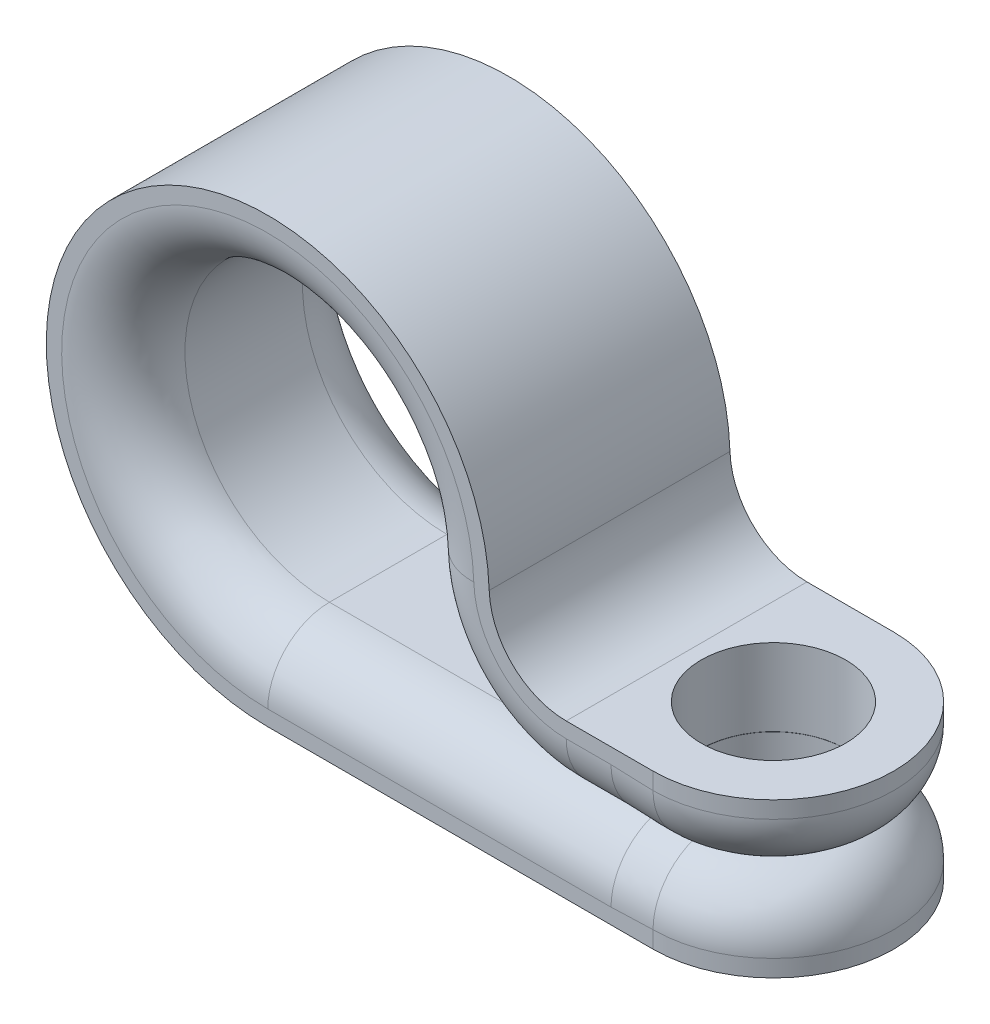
ISO-10303-21;
HEADER;
FILE_DESCRIPTION(('STEP AP214'),'2;1');
FILE_NAME('part.step','',(''),(''),'','','');
FILE_SCHEMA(('AUTOMOTIVE_DESIGN { 1 0 10303 214 1 1 1 1 }'));
ENDSEC;
DATA;
#1=APPLICATION_CONTEXT('core data for automotive mechanical design processes');
#2=APPLICATION_PROTOCOL_DEFINITION('international standard','automotive_design',2000,#1);
#3=PRODUCT_CONTEXT('',#1,'mechanical');
#4=PRODUCT('Part','Part','',(#3));
#5=PRODUCT_RELATED_PRODUCT_CATEGORY('part','',(#4));
#6=PRODUCT_DEFINITION_FORMATION('','',#4);
#7=PRODUCT_DEFINITION_CONTEXT('part definition',#1,'design');
#8=PRODUCT_DEFINITION('design','',#6,#7);
#9=PRODUCT_DEFINITION_SHAPE('','',#8);
#10=(LENGTH_UNIT() NAMED_UNIT(*) SI_UNIT(.MILLI.,.METRE.));
#11=(NAMED_UNIT(*) PLANE_ANGLE_UNIT() SI_UNIT($,.RADIAN.));
#12=(NAMED_UNIT(*) SI_UNIT($,.STERADIAN.) SOLID_ANGLE_UNIT());
#13=UNCERTAINTY_MEASURE_WITH_UNIT(LENGTH_MEASURE(1.E-05),#10,'distance_accuracy_value','');
#14=(GEOMETRIC_REPRESENTATION_CONTEXT(3) GLOBAL_UNCERTAINTY_ASSIGNED_CONTEXT((#13)) GLOBAL_UNIT_ASSIGNED_CONTEXT((#10,
#11,#12)) REPRESENTATION_CONTEXT('',''));
#15=CARTESIAN_POINT('',(0.,0.,0.));
#16=DIRECTION('',(0.,0.,1.));
#17=DIRECTION('',(1.,0.,0.));
#18=AXIS2_PLACEMENT_3D('',#15,#16,#17);
#19=CARTESIAN_POINT('',(4.91860621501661,-2.37871,1.984375));
#20=DIRECTION('',(0.,1.,0.));
#21=DIRECTION('',(-1.,0.,0.));
#22=AXIS2_PLACEMENT_3D('',#19,#20,#21);
#23=PLANE('',#22);
#24=DIRECTION('',(0.,0.,-1.));
#25=VECTOR('',#24,1.);
#26=CARTESIAN_POINT('',(4.91860621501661,-2.37871,1.984375));
#27=LINE('',#26,#25);
#28=CARTESIAN_POINT('',(4.91860621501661,-2.37871,0.968375));
#29=VERTEX_POINT('',#28);
#30=CARTESIAN_POINT('',(4.91860621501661,-2.37871,-0.968375));
#31=VERTEX_POINT('',#30);
#32=EDGE_CURVE('E224',#29,#31,#27,.T.);
#33=ORIENTED_EDGE('',*,*,#32,.T.);
#34=DIRECTION('',(1.,0.,0.));
#35=VECTOR('',#34,1.);
#36=CARTESIAN_POINT('',(4.91860621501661,-2.37871,-0.968375));
#37=LINE('',#36,#35);
#38=CARTESIAN_POINT('',(5.65729678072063,-2.37871,-0.968375));
#39=VERTEX_POINT('',#38);
#40=EDGE_CURVE('E528',#31,#39,#37,.T.);
#41=ORIENTED_EDGE('',*,*,#40,.T.);
#42=CARTESIAN_POINT('',(6.35,-2.37871,0.));
#43=DIRECTION('',(0.,1.,0.));
#44=DIRECTION('',(-1.,0.,0.));
#45=AXIS2_PLACEMENT_3D('',#42,#43,#44);
#46=CIRCLE('',#45,1.190625);
#47=CARTESIAN_POINT('',(5.65729678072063,-2.37871,0.968375));
#48=VERTEX_POINT('',#47);
#49=EDGE_CURVE('E204',#39,#48,#46,.T.);
#50=ORIENTED_EDGE('',*,*,#49,.T.);
#51=DIRECTION('',(1.,0.,0.));
#52=VECTOR('',#51,1.);
#53=CARTESIAN_POINT('',(4.91860621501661,-2.37871,0.968375));
#54=LINE('',#53,#52);
#55=EDGE_CURVE('E448',#48,#29,#54,.F.);
#56=ORIENTED_EDGE('',*,*,#55,.T.);
#57=EDGE_LOOP('',(#33,#41,#50,#56));
#58=FACE_BOUND('',#57,.T.);
#59=ADVANCED_FACE('F36',(#58),#23,.F.);
#60=CARTESIAN_POINT('',(4.91860621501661,-1.10871,1.984375));
#61=DIRECTION('',(0.,-1.,0.));
#62=DIRECTION('',(0.,0.,-1.));
#63=AXIS2_PLACEMENT_3D('',#60,#61,#62);
#64=PLANE('',#63);
#65=CARTESIAN_POINT('',(6.35,-1.10871,0.));
#66=DIRECTION('',(0.,-1.,0.));
#67=DIRECTION('',(0.,0.,-1.));
#68=AXIS2_PLACEMENT_3D('',#65,#66,#67);
#69=CIRCLE('',#68,1.190625);
#70=CARTESIAN_POINT('',(6.35,-1.10871,-1.190625));
#71=VERTEX_POINT('',#70);
#72=EDGE_CURVE('E232',#71,#71,#69,.T.);
#73=ORIENTED_EDGE('',*,*,#72,.T.);
#74=EDGE_LOOP('',(#73));
#75=FACE_BOUND('',#74,.T.);
#76=CARTESIAN_POINT('',(6.35,-1.10871,0.));
#77=DIRECTION('',(0.,-1.,0.));
#78=DIRECTION('',(0.,0.,-1.));
#79=AXIS2_PLACEMENT_3D('',#76,#77,#78);
#80=CIRCLE('',#79,1.984375);
#81=CARTESIAN_POINT('',(6.35,-1.10871,-1.984375));
#82=VERTEX_POINT('',#81);
#83=CARTESIAN_POINT('',(6.35,-1.10871,1.984375));
#84=VERTEX_POINT('',#83);
#85=EDGE_CURVE('E170',#82,#84,#80,.T.);
#86=ORIENTED_EDGE('',*,*,#85,.F.);
#87=DIRECTION('',(-1.,0.,0.));
#88=VECTOR('',#87,1.);
#89=CARTESIAN_POINT('',(4.91860621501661,-1.10871,-1.984375));
#90=LINE('',#89,#88);
#91=CARTESIAN_POINT('',(4.91860621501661,-1.10871,-1.984375));
#92=VERTEX_POINT('',#91);
#93=EDGE_CURVE('E175',#82,#92,#90,.T.);
#94=ORIENTED_EDGE('',*,*,#93,.T.);
#95=DIRECTION('',(0.,0.,-1.));
#96=VECTOR('',#95,1.);
#97=CARTESIAN_POINT('',(4.91860621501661,-1.10871,1.984375));
#98=LINE('',#97,#96);
#99=CARTESIAN_POINT('',(4.91860621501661,-1.10871,1.984375));
#100=VERTEX_POINT('',#99);
#101=EDGE_CURVE('E222',#100,#92,#98,.T.);
#102=ORIENTED_EDGE('',*,*,#101,.F.);
#103=DIRECTION('',(-1.,0.,0.));
#104=VECTOR('',#103,1.);
#105=CARTESIAN_POINT('',(4.91860621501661,-1.10871,1.984375));
#106=LINE('',#105,#104);
#107=EDGE_CURVE('E177',#84,#100,#106,.T.);
#108=ORIENTED_EDGE('',*,*,#107,.F.);
#109=EDGE_LOOP('',(#86,#94,#102,#108));
#110=FACE_BOUND('',#109,.T.);
#111=ADVANCED_FACE('F172',(#75,#110),#64,.F.);
#112=CARTESIAN_POINT('',(0.,-3.65125,1.984375));
#113=DIRECTION('',(0.,1.,0.));
#114=DIRECTION('',(-1.,0.,0.));
#115=AXIS2_PLACEMENT_3D('',#112,#113,#114);
#116=PLANE('',#115);
#117=CARTESIAN_POINT('',(6.35,-3.65125,0.));
#118=DIRECTION('',(0.,1.,0.));
#119=DIRECTION('',(0.,0.,1.));
#120=AXIS2_PLACEMENT_3D('',#117,#118,#119);
#121=CIRCLE('',#120,1.190625);
#122=CARTESIAN_POINT('',(6.35,-3.65125,1.190625));
#123=VERTEX_POINT('',#122);
#124=EDGE_CURVE('E181',#123,#123,#121,.T.);
#125=ORIENTED_EDGE('',*,*,#124,.T.);
#126=EDGE_LOOP('',(#125));
#127=FACE_BOUND('',#126,.T.);
#128=CARTESIAN_POINT('',(6.35,-3.65125,0.));
#129=DIRECTION('',(0.,1.,0.));
#130=DIRECTION('',(-1.,0.,0.));
#131=AXIS2_PLACEMENT_3D('',#128,#129,#130);
#132=CIRCLE('',#131,1.984375);
#133=CARTESIAN_POINT('',(6.35,-3.65125,1.984375));
#134=VERTEX_POINT('',#133);
#135=CARTESIAN_POINT('',(6.35,-3.65125,-1.984375));
#136=VERTEX_POINT('',#135);
#137=EDGE_CURVE('E182',#134,#136,#132,.T.);
#138=ORIENTED_EDGE('',*,*,#137,.F.);
#139=DIRECTION('',(1.,0.,0.));
#140=VECTOR('',#139,1.);
#141=CARTESIAN_POINT('',(0.,-3.65125,1.984375));
#142=LINE('',#141,#140);
#143=CARTESIAN_POINT('',(0.,-3.65125,1.984375));
#144=VERTEX_POINT('',#143);
#145=EDGE_CURVE('E206',#144,#134,#142,.T.);
#146=ORIENTED_EDGE('',*,*,#145,.F.);
#147=DIRECTION('',(0.,0.,-1.));
#148=VECTOR('',#147,1.);
#149=CARTESIAN_POINT('',(0.,-3.65125,1.984375));
#150=LINE('',#149,#148);
#151=CARTESIAN_POINT('',(0.,-3.65125,-1.984375));
#152=VERTEX_POINT('',#151);
#153=EDGE_CURVE('E216',#144,#152,#150,.T.);
#154=ORIENTED_EDGE('',*,*,#153,.T.);
#155=DIRECTION('',(1.,0.,0.));
#156=VECTOR('',#155,1.);
#157=CARTESIAN_POINT('',(0.,-3.65125,-1.984375));
#158=LINE('',#157,#156);
#159=EDGE_CURVE('E210',#152,#136,#158,.T.);
#160=ORIENTED_EDGE('',*,*,#159,.T.);
#161=EDGE_LOOP('',(#138,#146,#154,#160));
#162=FACE_BOUND('',#161,.T.);
#163=ADVANCED_FACE('F362',(#127,#162),#116,.F.);
#164=CARTESIAN_POINT('',(0.,-2.38125,1.984375));
#165=DIRECTION('',(0.,-1.,0.));
#166=DIRECTION('',(1.,0.,0.));
#167=AXIS2_PLACEMENT_3D('',#164,#165,#166);
#168=PLANE('',#167);
#169=CARTESIAN_POINT('',(6.35,-2.38125,0.));
#170=DIRECTION('',(0.,-1.,0.));
#171=DIRECTION('',(1.,0.,0.));
#172=AXIS2_PLACEMENT_3D('',#169,#170,#171);
#173=CIRCLE('',#172,1.190625);
#174=CARTESIAN_POINT('',(5.65729678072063,-2.38125,0.968375));
#175=VERTEX_POINT('',#174);
#176=CARTESIAN_POINT('',(5.65729678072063,-2.38125,-0.968375));
#177=VERTEX_POINT('',#176);
#178=EDGE_CURVE('E233',#175,#177,#173,.T.);
#179=ORIENTED_EDGE('',*,*,#178,.T.);
#180=DIRECTION('',(-1.,0.,0.));
#181=VECTOR('',#180,1.);
#182=CARTESIAN_POINT('',(0.,-2.38125,-0.968375));
#183=LINE('',#182,#181);
#184=CARTESIAN_POINT('',(0.,-2.38125,-0.968375));
#185=VERTEX_POINT('',#184);
#186=EDGE_CURVE('E237',#177,#185,#183,.T.);
#187=ORIENTED_EDGE('',*,*,#186,.T.);
#188=DIRECTION('',(0.,0.,-1.));
#189=VECTOR('',#188,1.);
#190=CARTESIAN_POINT('',(0.,-2.38125,1.984375));
#191=LINE('',#190,#189);
#192=CARTESIAN_POINT('',(0.,-2.38125,0.968375));
#193=VERTEX_POINT('',#192);
#194=EDGE_CURVE('E213',#193,#185,#191,.T.);
#195=ORIENTED_EDGE('',*,*,#194,.F.);
#196=DIRECTION('',(-1.,0.,0.));
#197=VECTOR('',#196,1.);
#198=CARTESIAN_POINT('',(6.35,-2.38125,0.968375));
#199=LINE('',#198,#197);
#200=EDGE_CURVE('E190',#193,#175,#199,.F.);
#201=ORIENTED_EDGE('',*,*,#200,.T.);
#202=EDGE_LOOP('',(#179,#187,#195,#201));
#203=FACE_BOUND('',#202,.T.);
#204=ADVANCED_FACE('F358',(#203),#168,.F.);
#205=CARTESIAN_POINT('',(0.,0.,1.984375));
#206=DIRECTION('',(0.,0.,-1.));
#207=DIRECTION('',(-1.,0.,0.));
#208=AXIS2_PLACEMENT_3D('',#205,#206,#207);
#209=CYLINDRICAL_SURFACE('',#208,2.38125);
#210=ORIENTED_EDGE('',*,*,#194,.T.);
#211=CARTESIAN_POINT('',(0.,0.,-0.968375));
#212=DIRECTION('',(0.,0.,1.));
#213=DIRECTION('',(1.,0.,0.));
#214=AXIS2_PLACEMENT_3D('',#211,#212,#213);
#215=CIRCLE('',#214,2.38125);
#216=CARTESIAN_POINT('',(2.37997074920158,0.0780435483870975,-0.968375));
#217=VERTEX_POINT('',#216);
#218=EDGE_CURVE('E452',#185,#217,#215,.F.);
#219=ORIENTED_EDGE('',*,*,#218,.T.);
#220=DIRECTION('',(0.,0.,-1.));
#221=VECTOR('',#220,1.);
#222=CARTESIAN_POINT('',(2.37997074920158,0.0780435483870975,1.984375));
#223=LINE('',#222,#221);
#224=CARTESIAN_POINT('',(2.37997074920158,0.0780435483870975,0.968375));
#225=VERTEX_POINT('',#224);
#226=EDGE_CURVE('E227',#225,#217,#223,.T.);
#227=ORIENTED_EDGE('',*,*,#226,.F.);
#228=CARTESIAN_POINT('',(0.,0.,0.968375));
#229=DIRECTION('',(0.,0.,1.));
#230=DIRECTION('',(1.,0.,0.));
#231=AXIS2_PLACEMENT_3D('',#228,#229,#230);
#232=CIRCLE('',#231,2.38125);
#233=EDGE_CURVE('E509',#225,#193,#232,.T.);
#234=ORIENTED_EDGE('',*,*,#233,.T.);
#235=EDGE_LOOP('',(#210,#219,#227,#234));
#236=FACE_BOUND('',#235,.T.);
#237=ADVANCED_FACE('F258',(#236),#209,.F.);
#238=CARTESIAN_POINT('',(4.91860621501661,0.16129,1.984375));
#239=DIRECTION('',(0.,0.,-1.));
#240=DIRECTION('',(-1.,0.,0.));
#241=AXIS2_PLACEMENT_3D('',#238,#239,#240);
#242=CYLINDRICAL_SURFACE('',#241,2.54);
#243=ORIENTED_EDGE('',*,*,#226,.T.);
#244=CARTESIAN_POINT('',(4.91860621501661,0.16129,-0.968375));
#245=DIRECTION('',(0.,0.,1.));
#246=DIRECTION('',(1.,0.,0.));
#247=AXIS2_PLACEMENT_3D('',#244,#245,#246);
#248=CIRCLE('',#247,2.54);
#249=EDGE_CURVE('E436',#217,#31,#248,.T.);
#250=ORIENTED_EDGE('',*,*,#249,.T.);
#251=ORIENTED_EDGE('',*,*,#32,.F.);
#252=CARTESIAN_POINT('',(4.91860621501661,0.16129,0.968375));
#253=DIRECTION('',(0.,0.,1.));
#254=DIRECTION('',(1.,0.,0.));
#255=AXIS2_PLACEMENT_3D('',#252,#253,#254);
#256=CIRCLE('',#255,2.54);
#257=EDGE_CURVE('E438',#29,#225,#256,.F.);
#258=ORIENTED_EDGE('',*,*,#257,.T.);
#259=EDGE_LOOP('',(#243,#250,#251,#258));
#260=FACE_BOUND('',#259,.T.);
#261=ADVANCED_FACE('F422',(#260),#242,.T.);
#262=CARTESIAN_POINT('',(4.91860621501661,0.16129,1.984375));
#263=DIRECTION('',(0.,0.,-1.));
#264=DIRECTION('',(-1.,0.,0.));
#265=AXIS2_PLACEMENT_3D('',#262,#263,#264);
#266=CYLINDRICAL_SURFACE('',#265,1.27);
#267=CARTESIAN_POINT('',(4.91860621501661,0.16129,-1.984375));
#268=DIRECTION('',(0.,0.,-1.));
#269=DIRECTION('',(1.,0.,0.));
#270=AXIS2_PLACEMENT_3D('',#267,#268,#269);
#271=CIRCLE('',#270,1.27);
#272=CARTESIAN_POINT('',(3.6492884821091,0.119666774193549,-1.984375));
#273=VERTEX_POINT('',#272);
#274=EDGE_CURVE('E196',#92,#273,#271,.T.);
#275=ORIENTED_EDGE('',*,*,#274,.T.);
#276=DIRECTION('',(0.,0.,-1.));
#277=VECTOR('',#276,1.);
#278=CARTESIAN_POINT('',(3.6492884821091,0.119666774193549,1.984375));
#279=LINE('',#278,#277);
#280=CARTESIAN_POINT('',(3.6492884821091,0.119666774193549,1.984375));
#281=VERTEX_POINT('',#280);
#282=EDGE_CURVE('E219',#281,#273,#279,.T.);
#283=ORIENTED_EDGE('',*,*,#282,.F.);
#284=CARTESIAN_POINT('',(4.91860621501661,0.16129,1.984375));
#285=DIRECTION('',(0.,0.,-1.));
#286=DIRECTION('',(1.,0.,0.));
#287=AXIS2_PLACEMENT_3D('',#284,#285,#286);
#288=CIRCLE('',#287,1.27);
#289=EDGE_CURVE('E491',#100,#281,#288,.T.);
#290=ORIENTED_EDGE('',*,*,#289,.F.);
#291=ORIENTED_EDGE('',*,*,#101,.T.);
#292=EDGE_LOOP('',(#275,#283,#290,#291));
#293=FACE_BOUND('',#292,.T.);
#294=ADVANCED_FACE('F425',(#293),#266,.F.);
#295=CARTESIAN_POINT('',(0.,0.,1.984375));
#296=DIRECTION('',(0.,0.,-1.));
#297=DIRECTION('',(-1.,0.,0.));
#298=AXIS2_PLACEMENT_3D('',#295,#296,#297);
#299=CYLINDRICAL_SURFACE('',#298,3.65125);
#300=CARTESIAN_POINT('',(0.,0.,-1.984375));
#301=DIRECTION('',(0.,0.,1.));
#302=DIRECTION('',(1.,0.,0.));
#303=AXIS2_PLACEMENT_3D('',#300,#301,#302);
#304=CIRCLE('',#303,3.65125);
#305=EDGE_CURVE('E199',#273,#152,#304,.T.);
#306=ORIENTED_EDGE('',*,*,#305,.T.);
#307=ORIENTED_EDGE('',*,*,#153,.F.);
#308=CARTESIAN_POINT('',(0.,0.,1.984375));
#309=DIRECTION('',(0.,0.,1.));
#310=DIRECTION('',(1.,0.,0.));
#311=AXIS2_PLACEMENT_3D('',#308,#309,#310);
#312=CIRCLE('',#311,3.65125);
#313=EDGE_CURVE('E492',#281,#144,#312,.T.);
#314=ORIENTED_EDGE('',*,*,#313,.F.);
#315=ORIENTED_EDGE('',*,*,#282,.T.);
#316=EDGE_LOOP('',(#306,#307,#314,#315));
#317=FACE_BOUND('',#316,.T.);
#318=ADVANCED_FACE('F300',(#317),#299,.T.);
#319=CARTESIAN_POINT('',(0.,0.,1.984375));
#320=DIRECTION('',(0.,0.,1.));
#321=DIRECTION('',(1.,0.,0.));
#322=AXIS2_PLACEMENT_3D('',#319,#320,#321);
#323=PLANE('',#322);
#324=DIRECTION('',(1.,0.,0.));
#325=VECTOR('',#324,1.);
#326=CARTESIAN_POINT('',(6.35,-1.36271,1.984375));
#327=LINE('',#326,#325);
#328=CARTESIAN_POINT('',(4.91860621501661,-1.36271,1.984375));
#329=VERTEX_POINT('',#328);
#330=CARTESIAN_POINT('',(5.65729678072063,-1.36271,1.984375));
#331=VERTEX_POINT('',#330);
#332=EDGE_CURVE('E58',#329,#331,#327,.T.);
#333=ORIENTED_EDGE('',*,*,#332,.T.);
#334=CARTESIAN_POINT('',(7.42108602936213,-1.39479675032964,1.984375));
#335=CARTESIAN_POINT('',(7.19545026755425,-2.57626603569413,1.984375));
#336=CARTESIAN_POINT('',(7.2331793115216,-2.37871,0.798487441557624));
#337=CARTESIAN_POINT('',(7.38854888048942,-1.38857799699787,1.984375));
#338=CARTESIAN_POINT('',(7.19110552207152,-2.55902116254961,1.984375));
#339=CARTESIAN_POINT('',(7.2211101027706,-2.37871,0.811818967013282));
#340=CARTESIAN_POINT('',(7.35582742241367,-1.38340751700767,1.984375));
#341=CARTESIAN_POINT('',(7.18438867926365,-2.54129715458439,1.984375));
#342=CARTESIAN_POINT('',(7.20807011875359,-2.37871,0.825650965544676));
#343=CARTESIAN_POINT('',(7.29017843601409,-1.37493181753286,1.984375));
#344=CARTESIAN_POINT('',(7.16618508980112,-2.50581398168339,1.984375));
#345=CARTESIAN_POINT('',(7.17973700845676,-2.37871,0.854128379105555));
#346=CARTESIAN_POINT('',(7.25725117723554,-1.37162453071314,1.984375));
#347=CARTESIAN_POINT('',(7.15478402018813,-2.4880656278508,1.984375));
#348=CARTESIAN_POINT('',(7.16444640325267,-2.37871,0.868772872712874));
#349=CARTESIAN_POINT('',(7.19149293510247,-1.36664725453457,1.984375));
#350=CARTESIAN_POINT('',(7.1273607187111,-2.45321873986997,1.984375));
#351=CARTESIAN_POINT('',(7.13138202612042,-2.37871,0.898621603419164));
#352=CARTESIAN_POINT('',(7.15866270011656,-1.36496684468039,1.984375));
#353=CARTESIAN_POINT('',(7.1114476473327,-2.43611546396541,1.984375));
#354=CARTESIAN_POINT('',(7.11362490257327,-2.37871,0.913821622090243));
#355=CARTESIAN_POINT('',(7.09295494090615,-1.36293433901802,1.984375));
#356=CARTESIAN_POINT('',(7.07517320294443,-2.40295249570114,1.984375));
#357=CARTESIAN_POINT('',(7.07522733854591,-2.37871,0.944583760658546));
#358=CARTESIAN_POINT('',(7.06007740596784,-1.36258261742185,1.984375));
#359=CARTESIAN_POINT('',(7.05487931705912,-2.38687667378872,1.984375));
#360=CARTESIAN_POINT('',(7.05458608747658,-2.37871,0.960145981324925));
#361=CARTESIAN_POINT('',(6.96170152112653,-1.36308179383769,1.984375));
#362=CARTESIAN_POINT('',(6.98830719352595,-2.34133613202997,1.984375));
#363=CARTESIAN_POINT('',(6.98799293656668,-2.37871,1.00672118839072));
#364=CARTESIAN_POINT('',(6.8962175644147,-1.36547300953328,1.984375));
#365=CARTESIAN_POINT('',(6.93555464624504,-2.31357508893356,1.984375));
#366=CARTESIAN_POINT('',(6.93725508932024,-2.37871,1.03773734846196));
#367=CARTESIAN_POINT('',(6.79801633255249,-1.37020244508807,1.984375));
#368=CARTESIAN_POINT('',(6.84552452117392,-2.27814088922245,1.984375));
#369=CARTESIAN_POINT('',(6.85052215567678,-2.37871,1.08078722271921));
#370=CARTESIAN_POINT('',(6.76525906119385,-1.37197133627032,1.984375));
#371=CARTESIAN_POINT('',(6.81396505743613,-2.26740654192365,1.984375));
#372=CARTESIAN_POINT('',(6.81980972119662,-2.37871,1.09456828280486));
#373=CARTESIAN_POINT('',(6.69974658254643,-1.37555056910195,1.984375));
#374=CARTESIAN_POINT('',(6.74799563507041,-2.24824561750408,1.984375));
#375=CARTESIAN_POINT('',(6.75499932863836,-2.37871,1.12016887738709));
#376=CARTESIAN_POINT('',(6.66699137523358,-1.37736090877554,1.984375));
#377=CARTESIAN_POINT('',(6.7135556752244,-2.23977579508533,1.984375));
#378=CARTESIAN_POINT('',(6.72090153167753,-2.37871,1.13198850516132));
#379=CARTESIAN_POINT('',(6.60146139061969,-1.38070921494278,1.984375));
#380=CARTESIAN_POINT('',(6.64243995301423,-2.22528308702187,1.984375));
#381=CARTESIAN_POINT('',(6.64972611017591,-2.37871,1.1528769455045));
#382=CARTESIAN_POINT('',(6.56868661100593,-1.38224713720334,1.984375));
#383=CARTESIAN_POINT('',(6.60569749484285,-2.21922180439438,1.984375));
#384=CARTESIAN_POINT('',(6.61264800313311,-2.37871,1.16194531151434));
#385=CARTESIAN_POINT('',(6.50311611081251,-1.38478782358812,1.984375));
#386=CARTESIAN_POINT('',(6.53073099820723,-2.20963246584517,1.984375));
#387=CARTESIAN_POINT('',(6.53628890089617,-2.37871,1.17660278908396));
#388=CARTESIAN_POINT('',(6.47032039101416,-1.38579060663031,1.984375));
#389=CARTESIAN_POINT('',(6.49240735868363,-2.20607526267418,1.984375));
#390=CARTESIAN_POINT('',(6.49700798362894,-2.37871,1.18219202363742));
#391=CARTESIAN_POINT('',(6.40474210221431,-1.38708894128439,1.984375));
#392=CARTESIAN_POINT('',(6.41514396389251,-2.2015339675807,1.984375));
#393=CARTESIAN_POINT('',(6.41735884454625,-2.37871,1.18938939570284));
#394=CARTESIAN_POINT('',(6.37195954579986,-1.3873850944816,1.984375));
#395=CARTESIAN_POINT('',(6.37608226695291,-2.20053290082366,1.984375));
#396=CARTESIAN_POINT('',(6.37699157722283,-2.37871,1.19100091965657));
#397=CARTESIAN_POINT('',(6.30639636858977,-1.38722093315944,1.984375));
#398=CARTESIAN_POINT('',(6.29818470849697,-2.2010951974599,1.984375));
#399=CARTESIAN_POINT('',(6.29639850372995,-2.37871,1.19010039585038));
#400=CARTESIAN_POINT('',(6.27361574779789,-1.38676061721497,1.984375));
#401=CARTESIAN_POINT('',(6.25921921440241,-2.20266043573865,1.984375));
#402=CARTESIAN_POINT('',(6.25617269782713,-2.37871,1.18758834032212));
#403=CARTESIAN_POINT('',(6.20803069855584,-1.38516166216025,1.984375));
#404=CARTESIAN_POINT('',(6.18231358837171,-2.20832011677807,1.984375));
#405=CARTESIAN_POINT('',(6.17704994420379,-2.37871,1.17867060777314));
#406=CARTESIAN_POINT('',(6.17522629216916,-1.38402216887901,1.984375));
#407=CARTESIAN_POINT('',(6.14425594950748,-2.21243599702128,1.984375));
#408=CARTESIAN_POINT('',(6.13815473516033,-2.37871,1.17226002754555));
#409=CARTESIAN_POINT('',(6.10963779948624,-1.3812589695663,1.984375));
#410=CARTESIAN_POINT('',(6.0699830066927,-2.22312528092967,1.984375));
#411=CARTESIAN_POINT('',(6.06276843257,-2.37871,1.15610289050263));
#412=CARTESIAN_POINT('',(6.07685371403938,-1.37963524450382,1.984375));
#413=CARTESIAN_POINT('',(6.03367473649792,-2.22973045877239,1.984375));
#414=CARTESIAN_POINT('',(6.02627743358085,-2.37871,1.14635620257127));
#415=CARTESIAN_POINT('',(6.01128204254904,-1.37618017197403,1.984375));
#416=CARTESIAN_POINT('',(5.96353864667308,-2.24528866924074,1.984375));
#417=CARTESIAN_POINT('',(5.95637740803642,-2.37871,1.12427531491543));
#418=CARTESIAN_POINT('',(5.97849446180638,-1.3743487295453,1.984375));
#419=CARTESIAN_POINT('',(5.92965363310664,-2.25428306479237,1.984375));
#420=CARTESIAN_POINT('',(5.92296980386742,-2.37871,1.11193992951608));
#421=CARTESIAN_POINT('',(5.91291312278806,-1.3708020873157,1.984375));
#422=CARTESIAN_POINT('',(5.86492235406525,-2.27445902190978,1.984375));
#423=CARTESIAN_POINT('',(5.8596054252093,-2.37871,1.08548659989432));
#424=CARTESIAN_POINT('',(5.88011936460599,-1.36908688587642,1.984375));
#425=CARTESIAN_POINT('',(5.83405396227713,-2.28568403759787,1.984375));
#426=CARTESIAN_POINT('',(5.82964860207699,-2.37871,1.0713686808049));
#427=CARTESIAN_POINT('',(5.81449972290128,-1.36611048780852,1.984375));
#428=CARTESIAN_POINT('',(5.77578797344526,-2.31011064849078,1.984375));
#429=CARTESIAN_POINT('',(5.7732407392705,-2.37871,1.04208814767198));
#430=CARTESIAN_POINT('',(5.78167383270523,-1.36484942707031,1.984375));
#431=CARTESIAN_POINT('',(5.74840260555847,-2.32335428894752,1.984375));
#432=CARTESIAN_POINT('',(5.74679075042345,-2.37871,1.02692522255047));
#433=CARTESIAN_POINT('',(5.71600395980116,-1.36311463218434,1.984375));
#434=CARTESIAN_POINT('',(5.69747882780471,-2.35153333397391,1.984375));
#435=CARTESIAN_POINT('',(5.6972744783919,-2.37871,0.99618609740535));
#436=CARTESIAN_POINT('',(5.68315998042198,-1.36264078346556,1.984375));
#437=CARTESIAN_POINT('',(5.67397800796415,-2.36650363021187,1.984375));
#438=CARTESIAN_POINT('',(5.67420770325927,-2.37871,0.980609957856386));
#439=CARTESIAN_POINT('',(5.61759098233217,-1.36279527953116,1.984375));
#440=CARTESIAN_POINT('',(5.63119252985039,-2.39772619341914,1.984375));
#441=CARTESIAN_POINT('',(5.63127516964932,-2.37871,0.949590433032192));
#442=CARTESIAN_POINT('',(5.58486597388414,-1.36341954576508,1.984375));
#443=CARTESIAN_POINT('',(5.61194911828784,-2.41399952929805,1.984375));
#444=CARTESIAN_POINT('',(5.61139786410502,-2.37871,0.934146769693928));
#445=CARTESIAN_POINT('',(5.51947169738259,-1.36604606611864,1.984375));
#446=CARTESIAN_POINT('',(5.57778262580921,-2.44745151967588,1.984375));
#447=CARTESIAN_POINT('',(5.57443313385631,-2.37871,0.903689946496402));
#448=CARTESIAN_POINT('',(5.48680243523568,-1.3680484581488,1.984375));
#449=CARTESIAN_POINT('',(5.56293046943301,-2.46464346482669,1.984375));
#450=CARTESIAN_POINT('',(5.55734598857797,-2.37871,0.888676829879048));
#451=CARTESIAN_POINT('',(5.38884329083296,-1.3765398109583,1.984375));
#452=CARTESIAN_POINT('',(5.52475280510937,-2.51732473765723,1.984375));
#453=CARTESIAN_POINT('',(5.50970358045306,-2.37871,0.84461777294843));
#454=CARTESIAN_POINT('',(5.3237192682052,-1.38551464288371,1.984375));
#455=CARTESIAN_POINT('',(5.50896345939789,-2.55302037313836,1.984375));
#456=CARTESIAN_POINT('',(5.48284148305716,-2.37871,0.816609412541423));
#457=CARTESIAN_POINT('',(5.22686519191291,-1.40529960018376,1.984375));
#458=CARTESIAN_POINT('',(5.49868337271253,-2.60408357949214,1.984375));
#459=CARTESIAN_POINT('',(5.44798133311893,-2.37871,0.777338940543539));
#460=CARTESIAN_POINT('',(5.19449430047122,-1.41302566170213,1.984375));
#461=CARTESIAN_POINT('',(5.49760601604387,-2.62095764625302,1.984375));
#462=CARTESIAN_POINT('',(5.43721064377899,-2.37871,0.764626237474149));
#463=CARTESIAN_POINT('',(5.1303491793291,-1.43077893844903,1.984375));
#464=CARTESIAN_POINT('',(5.49990370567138,-2.65324464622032,1.984375));
#465=CARTESIAN_POINT('',(5.41730804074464,-2.37871,0.740216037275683));
#466=CARTESIAN_POINT('',(5.09857573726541,-1.44080898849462,1.984375));
#467=CARTESIAN_POINT('',(5.50335224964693,-2.66861700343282,1.984375));
#468=CARTESIAN_POINT('',(5.40817817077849,-2.37871,0.728519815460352));
#469=CARTESIAN_POINT('',(5.06721780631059,-1.45206421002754,1.984375));
#470=CARTESIAN_POINT('',(5.50885572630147,-2.68278241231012,1.984375));
#471=CARTESIAN_POINT('',(5.39974065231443,-2.37871,0.717352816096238));
#472=(BOUNDED_SURFACE() B_SPLINE_SURFACE(3,2,((#334,#335,#336),(#337,#338,#339),(#340,#341,
#342),(#343,#344,#345),(#346,#347,#348),(#349,#350,#351),(#352,#353,#354),(#355,#356,#357),
(#358,#359,#360),(#361,#362,#363),(#364,#365,#366),(#367,#368,#369),(#370,#371,#372),(#373,#374,
#375),(#376,#377,#378),(#379,#380,#381),(#382,#383,#384),(#385,#386,#387),(#388,#389,#390),
(#391,#392,#393),(#394,#395,#396),(#397,#398,#399),(#400,#401,#402),(#403,#404,#405),(#406,#407,
#408),(#409,#410,#411),(#412,#413,#414),(#415,#416,#417),(#418,#419,#420),(#421,#422,#423),
(#424,#425,#426),(#427,#428,#429),(#430,#431,#432),(#433,#434,#435),(#436,#437,#438),(#439,#440,
#441),(#442,#443,#444),(#445,#446,#447),(#448,#449,#450),(#451,#452,#453),(#454,#455,#456),
(#457,#458,#459),(#460,#461,#462),(#463,#464,#465),(#466,#467,#468),(#469,#470,#471)),
.UNSPECIFIED.,.F.,.F.,.F.) B_SPLINE_SURFACE_WITH_KNOTS((4,2,2,2,2,2,2,2,2,2,2,2,2,2,2,2,2,2,2,2,
2,2,4),(3,3),(0.,0.0993385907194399,0.19856674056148,0.297155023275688,0.3957710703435,
0.59227662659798,0.690695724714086,0.789110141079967,0.88754052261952,0.985967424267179,
1.08431050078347,1.18265376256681,1.28112096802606,1.37959204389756,1.47810832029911,
1.57662320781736,1.67516754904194,1.77369754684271,1.87186236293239,1.97003700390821,
2.16673676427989,2.26650146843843,2.36638958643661),(0.,1.),
.UNSPECIFIED.) GEOMETRIC_REPRESENTATION_ITEM() RATIONAL_B_SPLINE_SURFACE(((1.,0.645285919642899,
1.),(1.,0.65037068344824,1.),(1.,0.655583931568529,1.),(1.,0.666186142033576,1.),(1.,
0.671574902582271,1.),(1.,0.68242343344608,1.),(1.,0.68788252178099,1.),(1.,0.698800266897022,
1.),(1.,0.704258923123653,1.),(1.,0.720405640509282,1.),(1.,0.730906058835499,1.),(1.,
0.745214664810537,1.),(1.,0.749747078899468,1.),(1.,0.758102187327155,1.),(1.,0.761924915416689,
1.),(1.,0.768641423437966,1.),(1.,0.771535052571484,1.),(1.,0.776195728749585,1.),(1.,
0.777962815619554,1.),(1.,0.780236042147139,1.),(1.,0.780743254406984,1.),(1.,0.780459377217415,
1.),(1.,0.779668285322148,1.),(1.,0.776848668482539,1.),(1.,0.774818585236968,1.),(1.,
0.769670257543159,1.),(1.,0.766551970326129,1.),(1.,0.759430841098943,1.),(1.,0.755427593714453,
1.),(1.,0.746761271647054,1.),(1.,0.742098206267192,1.),(1.,0.732325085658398,1.),(1.,
0.727214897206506,1.),(1.,0.716738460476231,1.),(1.,0.711372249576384,1.),(1.,0.70056030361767,
1.),(1.,0.695114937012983,1.),(1.,0.684248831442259,1.),(1.,0.678828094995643,1.),(1.,
0.662729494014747,1.),(1.,0.652235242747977,1.),(1.,0.637190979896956,1.),(1.,0.632260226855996,
1.),(1.,0.622687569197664,1.),(1.,0.618046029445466,1.),(1.,0.613567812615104,1.))) REPRESENTATION_ITEM('') SURFACE());
#473=CARTESIAN_POINT('',(5.06721780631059,-1.45206421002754,1.984375));
#474=CARTESIAN_POINT('',(5.09857573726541,-1.44080898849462,1.984375));
#475=CARTESIAN_POINT('',(5.1303491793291,-1.43077893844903,1.984375));
#476=CARTESIAN_POINT('',(5.19449430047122,-1.41302566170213,1.984375));
#477=CARTESIAN_POINT('',(5.22686519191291,-1.40529960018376,1.984375));
#478=CARTESIAN_POINT('',(5.3237192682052,-1.38551464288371,1.984375));
#479=CARTESIAN_POINT('',(5.38884329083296,-1.3765398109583,1.984375));
#480=CARTESIAN_POINT('',(5.48680243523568,-1.3680484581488,1.984375));
#481=CARTESIAN_POINT('',(5.51947169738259,-1.36604606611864,1.984375));
#482=CARTESIAN_POINT('',(5.58486597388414,-1.36341954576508,1.984375));
#483=CARTESIAN_POINT('',(5.61759098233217,-1.36279527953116,1.984375));
#484=CARTESIAN_POINT('',(5.68315998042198,-1.36264078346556,1.984375));
#485=CARTESIAN_POINT('',(5.71600395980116,-1.36311463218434,1.984375));
#486=CARTESIAN_POINT('',(5.78167383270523,-1.36484942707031,1.984375));
#487=CARTESIAN_POINT('',(5.81449972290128,-1.36611048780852,1.984375));
#488=CARTESIAN_POINT('',(5.88011936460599,-1.36908688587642,1.984375));
#489=CARTESIAN_POINT('',(5.91291312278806,-1.3708020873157,1.984375));
#490=CARTESIAN_POINT('',(5.97849446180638,-1.3743487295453,1.984375));
#491=CARTESIAN_POINT('',(6.01128204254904,-1.37618017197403,1.984375));
#492=CARTESIAN_POINT('',(6.07685371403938,-1.37963524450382,1.984375));
#493=CARTESIAN_POINT('',(6.10963779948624,-1.3812589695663,1.984375));
#494=CARTESIAN_POINT('',(6.17522629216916,-1.38402216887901,1.984375));
#495=CARTESIAN_POINT('',(6.20803069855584,-1.38516166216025,1.984375));
#496=CARTESIAN_POINT('',(6.27361574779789,-1.38676061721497,1.984375));
#497=CARTESIAN_POINT('',(6.30639636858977,-1.38722093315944,1.984375));
#498=CARTESIAN_POINT('',(6.37195954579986,-1.3873850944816,1.984375));
#499=CARTESIAN_POINT('',(6.40474210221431,-1.38708894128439,1.984375));
#500=CARTESIAN_POINT('',(6.47032039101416,-1.38579060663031,1.984375));
#501=CARTESIAN_POINT('',(6.50311611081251,-1.38478782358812,1.984375));
#502=CARTESIAN_POINT('',(6.56868661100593,-1.38224713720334,1.984375));
#503=CARTESIAN_POINT('',(6.60146139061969,-1.38070921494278,1.984375));
#504=CARTESIAN_POINT('',(6.66699137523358,-1.37736090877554,1.984375));
#505=CARTESIAN_POINT('',(6.69974658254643,-1.37555056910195,1.984375));
#506=CARTESIAN_POINT('',(6.76525906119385,-1.37197133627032,1.984375));
#507=CARTESIAN_POINT('',(6.79801633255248,-1.37020244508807,1.984375));
#508=CARTESIAN_POINT('',(6.8962175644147,-1.36547300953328,1.984375));
#509=CARTESIAN_POINT('',(6.96170152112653,-1.36308179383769,1.984375));
#510=CARTESIAN_POINT('',(7.06007740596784,-1.36258261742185,1.984375));
#511=CARTESIAN_POINT('',(7.09295494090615,-1.36293433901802,1.984375));
#512=CARTESIAN_POINT('',(7.15866270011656,-1.36496684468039,1.984375));
#513=CARTESIAN_POINT('',(7.19149293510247,-1.36664725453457,1.984375));
#514=CARTESIAN_POINT('',(7.25725117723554,-1.37162453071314,1.984375));
#515=CARTESIAN_POINT('',(7.29017843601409,-1.37493181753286,1.984375));
#516=CARTESIAN_POINT('',(7.35582742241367,-1.38340751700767,1.984375));
#517=CARTESIAN_POINT('',(7.38854888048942,-1.38857799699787,1.984375));
#518=CARTESIAN_POINT('',(7.42108602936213,-1.39479675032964,1.984375));
#519=B_SPLINE_CURVE_WITH_KNOTS('',3,(#473,#474,#475,#476,#477,#478,#479,#480,#481,#482,#483,
#484,#485,#486,#487,#488,#489,#490,#491,#492,#493,#494,#495,#496,#497,#498,#499,#500,#501,#502,
#503,#504,#505,#506,#507,#508,#509,#510,#511,#512,#513,#514,#515,#516,#517,#518),.UNSPECIFIED.,
.F.,.F.,(4,2,2,2,2,2,2,2,2,2,2,2,2,2,2,2,2,2,2,2,2,2,4),(0.,0.0998881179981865,
0.199652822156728,0.396352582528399,0.494527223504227,0.592692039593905,0.691222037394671,
0.789766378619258,0.888281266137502,0.986797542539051,1.08526861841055,1.1837358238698,
1.28207908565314,1.38042216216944,1.47884906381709,1.57727944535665,1.67569386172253,
1.77411295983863,1.97061851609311,2.06923456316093,2.16782284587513,2.26705099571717,
2.36638958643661),.UNSPECIFIED.);
#520=CARTESIAN_POINT('',(6.35,-1.38731656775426,1.984375));
#521=VERTEX_POINT('',#520);
#522=EDGE_CURVE('E50',#331,#521,#519,.T.);
#523=ORIENTED_EDGE('',*,*,#522,.T.);
#524=DIRECTION('',(0.,-1.,0.));
#525=VECTOR('',#524,1.);
#526=CARTESIAN_POINT('',(6.35,18.3292528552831,1.984375));
#527=LINE('',#526,#525);
#528=EDGE_CURVE('E477',#84,#521,#527,.T.);
#529=ORIENTED_EDGE('',*,*,#528,.F.);
#530=ORIENTED_EDGE('',*,*,#107,.T.);
#531=ORIENTED_EDGE('',*,*,#289,.T.);
#532=ORIENTED_EDGE('',*,*,#313,.T.);
#533=ORIENTED_EDGE('',*,*,#145,.T.);
#534=CARTESIAN_POINT('',(6.35,-3.37264343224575,1.984375));
#535=VERTEX_POINT('',#534);
#536=EDGE_CURVE('E475',#535,#134,#527,.T.);
#537=ORIENTED_EDGE('',*,*,#536,.F.);
#538=CARTESIAN_POINT('',(7.23317929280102,-2.38125,0.798487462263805));
#539=CARTESIAN_POINT('',(7.19545025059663,-2.18369399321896,1.984375));
#540=CARTESIAN_POINT('',(7.42108602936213,-3.36516324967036,1.984375));
#541=CARTESIAN_POINT('',(7.22111009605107,-2.38125,0.811818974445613));
#542=CARTESIAN_POINT('',(7.19110551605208,-2.20093884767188,1.984375));
#543=CARTESIAN_POINT('',(7.38854888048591,-3.37138200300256,1.984375));
#544=CARTESIAN_POINT('',(7.20807011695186,-2.38125,0.825650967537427));
#545=CARTESIAN_POINT('',(7.18438867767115,-2.21866284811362,1.984375));
#546=CARTESIAN_POINT('',(7.35582742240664,-3.37655248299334,1.984375));
#547=CARTESIAN_POINT('',(7.17973701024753,-2.38125,0.854128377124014));
#548=CARTESIAN_POINT('',(7.16618509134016,-2.25414601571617,1.984375));
#549=CARTESIAN_POINT('',(7.2901784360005,-3.38502818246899,1.984375));
#550=CARTESIAN_POINT('',(7.16444640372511,-2.38125,0.868772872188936));
#551=CARTESIAN_POINT('',(7.15478402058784,-2.27189437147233,1.984375));
#552=CARTESIAN_POINT('',(7.25725117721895,-3.38833546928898,1.984375));
#553=CARTESIAN_POINT('',(7.13138202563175,-2.38125,0.898621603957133));
#554=CARTESIAN_POINT('',(7.12736071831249,-2.30674126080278,1.984375));
#555=CARTESIAN_POINT('',(7.19149293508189,-3.39331274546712,1.984375));
#556=CARTESIAN_POINT('',(7.11362490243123,-2.38125,0.913821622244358));
#557=CARTESIAN_POINT('',(7.1114476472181,-2.32384453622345,1.984375));
#558=CARTESIAN_POINT('',(7.15866270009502,-3.3949931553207,1.984375));
#559=CARTESIAN_POINT('',(7.07522733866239,-2.38125,0.944583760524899));
#560=CARTESIAN_POINT('',(7.07517320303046,-2.35700750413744,1.984375));
#561=CARTESIAN_POINT('',(7.09295494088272,-3.39702566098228,1.984375));
#562=CARTESIAN_POINT('',(7.05458608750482,-2.38125,0.960145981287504));
#563=CARTESIAN_POINT('',(7.05487931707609,-2.37308332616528,1.984375));
#564=CARTESIAN_POINT('',(7.06007740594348,-3.39737738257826,1.984375));
#565=CARTESIAN_POINT('',(6.98799293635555,-2.38125,1.00672118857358));
#566=CARTESIAN_POINT('',(6.98830719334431,-2.41862386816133,1.984375));
#567=CARTESIAN_POINT('',(6.96170152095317,-3.39687820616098,1.984375));
#568=CARTESIAN_POINT('',(6.93725508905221,-2.38125,1.03773734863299));
#569=CARTESIAN_POINT('',(6.93555464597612,-2.44638491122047,1.984375));
#570=CARTESIAN_POINT('',(6.8962175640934,-3.39448699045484,1.984375));
#571=CARTESIAN_POINT('',(6.85052215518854,-2.38125,1.0807872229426));
#572=CARTESIAN_POINT('',(6.8455245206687,-2.48181911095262,1.984375));
#573=CARTESIAN_POINT('',(6.79801633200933,-3.38975755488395,1.984375));
#574=CARTESIAN_POINT('',(6.81980972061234,-2.38125,1.09456828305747));
#575=CARTESIAN_POINT('',(6.81396505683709,-2.49255345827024,1.984375));
#576=CARTESIAN_POINT('',(6.76525906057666,-3.38798866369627,1.984375));
#577=CARTESIAN_POINT('',(6.75499932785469,-2.38125,1.12016887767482));
#578=CARTESIAN_POINT('',(6.74799563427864,-2.51171438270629,1.984375));
#579=CARTESIAN_POINT('',(6.69974658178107,-3.38440943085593,1.984375));
#580=CARTESIAN_POINT('',(6.72090153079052,-2.38125,1.13198850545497));
#581=CARTESIAN_POINT('',(6.71355567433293,-2.52018420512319,1.984375));
#582=CARTESIAN_POINT('',(6.66699137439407,-3.38259909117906,1.984375));
#583=CARTESIAN_POINT('',(6.6497261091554,-2.38125,1.15287694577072));
#584=CARTESIAN_POINT('',(6.64243995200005,-2.53467691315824,1.984375));
#585=CARTESIAN_POINT('',(6.6014613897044,-3.37925078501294,1.984375));
#586=CARTESIAN_POINT('',(6.61264800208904,-2.38125,1.16194531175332));
#587=CARTESIAN_POINT('',(6.60569749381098,-2.5407381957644,1.984375));
#588=CARTESIAN_POINT('',(6.56868661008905,-3.37771286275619,1.984375));
#589=CARTESIAN_POINT('',(6.53628889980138,-2.38125,1.17660278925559));
#590=CARTESIAN_POINT('',(6.53073099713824,-2.55032753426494,1.984375));
#591=CARTESIAN_POINT('',(6.50311610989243,-3.37517217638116,1.984375));
#592=CARTESIAN_POINT('',(6.49700798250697,-2.38125,1.18219202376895));
#593=CARTESIAN_POINT('',(6.49240735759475,-2.55388473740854,1.984375));
#594=CARTESIAN_POINT('',(6.47032039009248,-3.3741693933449,1.984375));
#595=CARTESIAN_POINT('',(6.41735884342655,-2.38125,1.18938939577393));
#596=CARTESIAN_POINT('',(6.41514396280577,-2.55842603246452,1.984375));
#597=CARTESIAN_POINT('',(6.40474210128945,-3.37287105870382,1.984375));
#598=CARTESIAN_POINT('',(6.37699157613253,-2.38125,1.19100091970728));
#599=CARTESIAN_POINT('',(6.3760822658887,-2.55942709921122,1.984375));
#600=CARTESIAN_POINT('',(6.37195954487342,-3.37257490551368,1.984375));
#601=CARTESIAN_POINT('',(6.29639850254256,-2.38125,1.19010039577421));
#602=CARTESIAN_POINT('',(6.29818470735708,-2.55886480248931,1.984375));
#603=CARTESIAN_POINT('',(6.30639636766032,-3.37273906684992,1.984375));
#604=CARTESIAN_POINT('',(6.25617269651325,-2.38125,1.18758834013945));
#605=CARTESIAN_POINT('',(6.25921921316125,-2.55729956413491,1.984375));
#606=CARTESIAN_POINT('',(6.27361574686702,-3.3731993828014,1.984375));
#607=CARTESIAN_POINT('',(6.17704994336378,-2.38125,1.17867060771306));
#608=CARTESIAN_POINT('',(6.18231358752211,-2.55163988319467,1.984375));
#609=CARTESIAN_POINT('',(6.2080306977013,-3.37479833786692,1.984375));
#610=CARTESIAN_POINT('',(6.13815473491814,-2.38125,1.17226002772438));
#611=CARTESIAN_POINT('',(6.14425594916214,-2.54752400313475,1.984375));
#612=CARTESIAN_POINT('',(6.17522629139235,-3.37593783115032,1.984375));
#613=CARTESIAN_POINT('',(6.06276843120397,-2.38125,1.15610288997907));
#614=CARTESIAN_POINT('',(6.0699830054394,-2.53683471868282,1.984375));
#615=CARTESIAN_POINT('',(6.10963779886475,-3.3787010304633,1.984375));
#616=CARTESIAN_POINT('',(6.02627743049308,-2.38125,1.14635620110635));
#617=CARTESIAN_POINT('',(6.03367473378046,-2.53022954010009,1.984375));
#618=CARTESIAN_POINT('',(6.0768537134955,-3.38032475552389,1.984375));
#619=CARTESIAN_POINT('',(5.9563774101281,-2.38125,1.12427531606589));
#620=CARTESIAN_POINT('',(5.96353864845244,-2.51467133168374,1.984375));
#621=CARTESIAN_POINT('',(6.01128204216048,-3.38377982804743,1.984375));
#622=CARTESIAN_POINT('',(5.92296981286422,-2.38125,1.11193993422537));
#623=CARTESIAN_POINT('',(5.92965364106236,-2.5056769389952,1.984375));
#624=CARTESIAN_POINT('',(5.97849446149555,-3.38561127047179,1.984375));
#625=CARTESIAN_POINT('',(5.85960541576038,-2.38125,1.08548659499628));
#626=CARTESIAN_POINT('',(5.86492234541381,-2.48550097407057,1.984375));
#627=CARTESIAN_POINT('',(5.91291312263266,-3.38915791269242,1.984375));
#628=CARTESIAN_POINT('',(5.82964856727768,-2.38125,1.07136866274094));
#629=CARTESIAN_POINT('',(5.83405393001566,-2.4742759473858,1.984375));
#630=CARTESIAN_POINT('',(5.88011936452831,-3.39087311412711,1.984375));
#631=CARTESIAN_POINT('',(5.77324070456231,-2.38125,1.04208812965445));
#632=CARTESIAN_POINT('',(5.7757879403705,-2.44984933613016,1.984375));
#633=CARTESIAN_POINT('',(5.81449972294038,-3.3938495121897,1.984375));
#634=CARTESIAN_POINT('',(5.7467907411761,-2.38125,1.02692521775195));
#635=CARTESIAN_POINT('',(5.74840259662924,-2.43660570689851,1.984375));
#636=CARTESIAN_POINT('',(5.78167383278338,-3.39511057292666,1.984375));
#637=CARTESIAN_POINT('',(5.69727448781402,-2.38125,0.996186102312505));
#638=CARTESIAN_POINT('',(5.69747883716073,-2.40842667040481,1.984375));
#639=CARTESIAN_POINT('',(5.7160039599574,-3.3968453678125,1.984375));
#640=CARTESIAN_POINT('',(5.67420770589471,-2.38125,0.980609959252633));
#641=CARTESIAN_POINT('',(5.67397801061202,-2.3934563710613,1.984375));
#642=CARTESIAN_POINT('',(5.68315998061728,-3.3973192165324,1.984375));
#643=CARTESIAN_POINT('',(5.63127516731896,-2.38125,0.949590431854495));
#644=CARTESIAN_POINT('',(5.631192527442,-2.36223380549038,1.984375));
#645=CARTESIAN_POINT('',(5.61759098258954,-3.39716472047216,1.984375));
#646=CARTESIAN_POINT('',(5.61139786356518,-2.38125,0.934146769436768));
#647=CARTESIAN_POINT('',(5.61194911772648,-2.34596047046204,1.984375));
#648=CARTESIAN_POINT('',(5.58486597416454,-3.39654045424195,1.984375));
#649=CARTESIAN_POINT('',(5.57443313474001,-2.38125,0.903689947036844));
#650=CARTESIAN_POINT('',(5.5777826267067,-2.31250848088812,1.984375));
#651=CARTESIAN_POINT('',(5.51947169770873,-3.3939139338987,1.984375));
#652=CARTESIAN_POINT('',(5.55734598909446,-2.38125,0.88867683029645));
#653=CARTESIAN_POINT('',(5.56293046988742,-2.29531653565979,1.984375));
#654=CARTESIAN_POINT('',(5.48680243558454,-3.39191154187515,1.984375));
#655=CARTESIAN_POINT('',(5.50970357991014,-2.38125,0.844617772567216));
#656=CARTESIAN_POINT('',(5.52475280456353,-2.24263526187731,1.984375));
#657=CARTESIAN_POINT('',(5.38884329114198,-3.38342018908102,1.984375));
#658=CARTESIAN_POINT('',(5.48284148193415,-2.38125,0.81660941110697));
#659=CARTESIAN_POINT('',(5.50896345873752,-2.20693962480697,1.984375));
#660=CARTESIAN_POINT('',(5.32371926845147,-3.37444535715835,1.984375));
#661=CARTESIAN_POINT('',(5.44798133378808,-2.38125,0.777338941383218));
#662=CARTESIAN_POINT('',(5.49868337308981,-2.15587642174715,1.984375));
#663=CARTESIAN_POINT('',(5.22686519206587,-3.35466039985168,1.984375));
#664=CARTESIAN_POINT('',(5.43721064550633,-2.38125,0.764626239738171));
#665=CARTESIAN_POINT('',(5.49760601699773,-2.13900235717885,1.984375));
#666=CARTESIAN_POINT('',(5.19449430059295,-3.34693433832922,1.984375));
#667=CARTESIAN_POINT('',(5.41730803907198,-2.38125,0.740216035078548));
#668=CARTESIAN_POINT('',(5.49990370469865,-2.10671535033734,1.984375));
#669=CARTESIAN_POINT('',(5.13034917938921,-3.32918106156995,1.984375));
#670=CARTESIAN_POINT('',(5.40817816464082,-2.38125,0.728519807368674));
#671=CARTESIAN_POINT('',(5.50335224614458,-2.09134298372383,1.984375));
#672=CARTESIAN_POINT('',(5.09857573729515,-3.31915101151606,1.984375));
#673=CARTESIAN_POINT('',(5.39974063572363,-2.38125,0.717352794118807));
#674=CARTESIAN_POINT('',(5.5088557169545,-2.07717755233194,1.984375));
#675=CARTESIAN_POINT('',(5.06721780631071,-3.30789578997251,1.984375));
#676=(BOUNDED_SURFACE() B_SPLINE_SURFACE(3,2,((#538,#539,#540),(#541,#542,#543),(#544,#545,
#546),(#547,#548,#549),(#550,#551,#552),(#553,#554,#555),(#556,#557,#558),(#559,#560,#561),
(#562,#563,#564),(#565,#566,#567),(#568,#569,#570),(#571,#572,#573),(#574,#575,#576),(#577,#578,
#579),(#580,#581,#582),(#583,#584,#585),(#586,#587,#588),(#589,#590,#591),(#592,#593,#594),
(#595,#596,#597),(#598,#599,#600),(#601,#602,#603),(#604,#605,#606),(#607,#608,#609),(#610,#611,
#612),(#613,#614,#615),(#616,#617,#618),(#619,#620,#621),(#622,#623,#624),(#625,#626,#627),
(#628,#629,#630),(#631,#632,#633),(#634,#635,#636),(#637,#638,#639),(#640,#641,#642),(#643,#644,
#645),(#646,#647,#648),(#649,#650,#651),(#652,#653,#654),(#655,#656,#657),(#658,#659,#660),
(#661,#662,#663),(#664,#665,#666),(#667,#668,#669),(#670,#671,#672),(#673,#674,#675)),
.UNSPECIFIED.,.F.,.F.,.F.) B_SPLINE_SURFACE_WITH_KNOTS((4,2,2,2,2,2,2,2,2,2,2,2,2,2,2,2,2,2,2,2,
2,2,4),(3,3),(0.,0.0993385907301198,0.198566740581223,0.297155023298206,0.395771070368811,
0.59227662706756,0.690695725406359,0.789110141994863,0.887540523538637,0.985967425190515,
1.08431050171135,1.18265376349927,1.2811209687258,1.37959204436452,1.47810832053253,
1.57662320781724,1.67516754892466,1.77369754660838,1.87186236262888,1.97003700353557,
2.16673676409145,2.26650146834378,2.36638958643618),(0.,1.),
.UNSPECIFIED.) GEOMETRIC_REPRESENTATION_ITEM() RATIONAL_B_SPLINE_SURFACE(((1.,0.645285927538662,
1.),(1.,0.650370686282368,1.),(1.,0.655583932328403,1.),(1.,0.666186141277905,1.),(1.,
0.671574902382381,1.),(1.,0.682423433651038,1.),(1.,0.687882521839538,1.),(1.,0.698800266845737,
1.),(1.,0.704258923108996,1.),(1.,0.720405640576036,1.),(1.,0.730906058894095,1.),(1.,
0.745214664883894,1.),(1.,0.749747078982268,1.),(1.,0.758102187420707,1.),(1.,0.761924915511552,
1.),(1.,0.768641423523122,1.),(1.,0.771535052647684,1.),(1.,0.776195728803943,1.),(1.,
0.777962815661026,1.),(1.,0.78023604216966,1.),(1.,0.780743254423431,1.),(1.,0.780459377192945,
1.),(1.,0.779668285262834,1.),(1.,0.776848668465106,1.),(1.,0.774818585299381,1.),(1.,
0.769670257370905,1.),(1.,0.766551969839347,1.),(1.,0.75943084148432,1.),(1.,0.755427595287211,
1.),(1.,0.74676127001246,1.),(1.,0.742098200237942,1.),(1.,0.73232507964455,1.),(1.,
0.727214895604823,1.),(1.,0.716738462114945,1.),(1.,0.711372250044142,1.),(1.,0.700560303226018,
1.),(1.,0.695114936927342,1.),(1.,0.684248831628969,1.),(1.,0.678828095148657,1.),(1.,
0.662729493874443,1.),(1.,0.652235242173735,1.),(1.,0.637190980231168,1.),(1.,0.632260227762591,
1.),(1.,0.622687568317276,1.),(1.,0.618046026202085,1.),(1.,0.613567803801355,1.))) REPRESENTATION_ITEM('') SURFACE());
#677=CARTESIAN_POINT('',(7.42108602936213,-3.36516324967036,1.984375));
#678=CARTESIAN_POINT('',(7.38854888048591,-3.37138200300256,1.984375));
#679=CARTESIAN_POINT('',(7.35582742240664,-3.37655248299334,1.984375));
#680=CARTESIAN_POINT('',(7.2901784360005,-3.38502818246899,1.984375));
#681=CARTESIAN_POINT('',(7.25725117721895,-3.38833546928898,1.984375));
#682=CARTESIAN_POINT('',(7.19149293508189,-3.39331274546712,1.984375));
#683=CARTESIAN_POINT('',(7.15866270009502,-3.3949931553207,1.984375));
#684=CARTESIAN_POINT('',(7.09295494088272,-3.39702566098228,1.984375));
#685=CARTESIAN_POINT('',(7.06007740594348,-3.39737738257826,1.984375));
#686=CARTESIAN_POINT('',(6.96170152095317,-3.39687820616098,1.984375));
#687=CARTESIAN_POINT('',(6.8962175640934,-3.39448699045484,1.984375));
#688=CARTESIAN_POINT('',(6.79801633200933,-3.38975755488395,1.984375));
#689=CARTESIAN_POINT('',(6.76525906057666,-3.38798866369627,1.984375));
#690=CARTESIAN_POINT('',(6.69974658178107,-3.38440943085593,1.984375));
#691=CARTESIAN_POINT('',(6.66699137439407,-3.38259909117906,1.984375));
#692=CARTESIAN_POINT('',(6.6014613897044,-3.37925078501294,1.984375));
#693=CARTESIAN_POINT('',(6.56868661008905,-3.37771286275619,1.984375));
#694=CARTESIAN_POINT('',(6.50311610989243,-3.37517217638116,1.984375));
#695=CARTESIAN_POINT('',(6.47032039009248,-3.3741693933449,1.984375));
#696=CARTESIAN_POINT('',(6.40474210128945,-3.37287105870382,1.984375));
#697=CARTESIAN_POINT('',(6.37195954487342,-3.37257490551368,1.984375));
#698=CARTESIAN_POINT('',(6.30639636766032,-3.37273906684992,1.984375));
#699=CARTESIAN_POINT('',(6.27361574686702,-3.3731993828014,1.984375));
#700=CARTESIAN_POINT('',(6.2080306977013,-3.37479833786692,1.984375));
#701=CARTESIAN_POINT('',(6.17522629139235,-3.37593783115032,1.984375));
#702=CARTESIAN_POINT('',(6.10963779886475,-3.3787010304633,1.984375));
#703=CARTESIAN_POINT('',(6.0768537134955,-3.38032475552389,1.984375));
#704=CARTESIAN_POINT('',(6.01128204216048,-3.38377982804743,1.984375));
#705=CARTESIAN_POINT('',(5.97849446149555,-3.38561127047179,1.984375));
#706=CARTESIAN_POINT('',(5.91291312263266,-3.38915791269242,1.984375));
#707=CARTESIAN_POINT('',(5.88011936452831,-3.39087311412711,1.984375));
#708=CARTESIAN_POINT('',(5.81449972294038,-3.3938495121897,1.984375));
#709=CARTESIAN_POINT('',(5.78167383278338,-3.39511057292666,1.984375));
#710=CARTESIAN_POINT('',(5.7160039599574,-3.3968453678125,1.984375));
#711=CARTESIAN_POINT('',(5.68315998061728,-3.3973192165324,1.984375));
#712=CARTESIAN_POINT('',(5.61759098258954,-3.39716472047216,1.984375));
#713=CARTESIAN_POINT('',(5.58486597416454,-3.39654045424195,1.984375));
#714=CARTESIAN_POINT('',(5.51947169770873,-3.3939139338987,1.984375));
#715=CARTESIAN_POINT('',(5.48680243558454,-3.39191154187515,1.984375));
#716=CARTESIAN_POINT('',(5.38884329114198,-3.38342018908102,1.984375));
#717=CARTESIAN_POINT('',(5.32371926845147,-3.37444535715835,1.984375));
#718=CARTESIAN_POINT('',(5.22686519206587,-3.35466039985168,1.984375));
#719=CARTESIAN_POINT('',(5.19449430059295,-3.34693433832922,1.984375));
#720=CARTESIAN_POINT('',(5.13034917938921,-3.32918106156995,1.984375));
#721=CARTESIAN_POINT('',(5.09857573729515,-3.31915101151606,1.984375));
#722=CARTESIAN_POINT('',(5.06721780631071,-3.30789578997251,1.984375));
#723=B_SPLINE_CURVE_WITH_KNOTS('',3,(#677,#678,#679,#680,#681,#682,#683,#684,#685,#686,#687,
#688,#689,#690,#691,#692,#693,#694,#695,#696,#697,#698,#699,#700,#701,#702,#703,#704,#705,#706,
#707,#708,#709,#710,#711,#712,#713,#714,#715,#716,#717,#718,#719,#720,#721,#722),.UNSPECIFIED.,
.F.,.F.,(4,2,2,2,2,2,2,2,2,2,2,2,2,2,2,2,2,2,2,2,2,2,4),(0.,0.0993385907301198,
0.198566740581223,0.297155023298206,0.395771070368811,0.59227662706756,0.690695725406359,
0.789110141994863,0.887540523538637,0.985967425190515,1.08431050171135,1.18265376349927,
1.2811209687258,1.37959204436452,1.47810832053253,1.57662320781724,1.67516754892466,
1.77369754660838,1.87186236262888,1.97003700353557,2.16673676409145,2.26650146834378,
2.36638958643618),.UNSPECIFIED.);
#724=CARTESIAN_POINT('',(5.65729678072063,-3.39725,1.984375));
#725=VERTEX_POINT('',#724);
#726=EDGE_CURVE('E315',#535,#725,#723,.T.);
#727=ORIENTED_EDGE('',*,*,#726,.T.);
#728=DIRECTION('',(-1.,0.,0.));
#729=VECTOR('',#728,1.);
#730=CARTESIAN_POINT('',(0.,-3.39725,1.984375));
#731=LINE('',#730,#729);
#732=CARTESIAN_POINT('',(0.,-3.39725,1.984375));
#733=VERTEX_POINT('',#732);
#734=EDGE_CURVE('E323',#725,#733,#731,.T.);
#735=ORIENTED_EDGE('',*,*,#734,.T.);
#736=CARTESIAN_POINT('',(0.,0.,1.984375));
#737=DIRECTION('',(0.,0.,1.));
#738=DIRECTION('',(1.,0.,0.));
#739=AXIS2_PLACEMENT_3D('',#736,#737,#738);
#740=CIRCLE('',#739,3.39725);
#741=CARTESIAN_POINT('',(3.39542493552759,0.111342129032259,1.984375));
#742=VERTEX_POINT('',#741);
#743=EDGE_CURVE('E322',#733,#742,#740,.F.);
#744=ORIENTED_EDGE('',*,*,#743,.T.);
#745=CARTESIAN_POINT('',(4.91860621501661,0.16129,1.984375));
#746=DIRECTION('',(0.,0.,1.));
#747=DIRECTION('',(1.,0.,0.));
#748=AXIS2_PLACEMENT_3D('',#745,#746,#747);
#749=CIRCLE('',#748,1.524);
#750=EDGE_CURVE('E63',#742,#329,#749,.T.);
#751=ORIENTED_EDGE('',*,*,#750,.T.);
#752=EDGE_LOOP('',(#333,#523,#529,#530,#531,#532,#533,#537,#727,#735,#744,#751));
#753=FACE_BOUND('',#752,.T.);
#754=ADVANCED_FACE('F297',(#753),#323,.T.);
#755=CARTESIAN_POINT('',(0.,0.,-1.984375));
#756=DIRECTION('',(0.,0.,1.));
#757=DIRECTION('',(1.,0.,0.));
#758=AXIS2_PLACEMENT_3D('',#755,#756,#757);
#759=PLANE('',#758);
#760=DIRECTION('',(-1.,0.,0.));
#761=VECTOR('',#760,1.);
#762=CARTESIAN_POINT('',(0.,-3.39725,-1.984375));
#763=LINE('',#762,#761);
#764=CARTESIAN_POINT('',(0.,-3.39725,-1.984375));
#765=VERTEX_POINT('',#764);
#766=CARTESIAN_POINT('',(5.65729678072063,-3.39725,-1.984375));
#767=VERTEX_POINT('',#766);
#768=EDGE_CURVE('E541',#765,#767,#763,.F.);
#769=ORIENTED_EDGE('',*,*,#768,.T.);
#770=CARTESIAN_POINT('',(7.42108602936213,-3.36516324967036,-1.984375));
#771=CARTESIAN_POINT('',(7.19545026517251,-2.18369396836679,-1.984375));
#772=CARTESIAN_POINT('',(7.23317930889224,-2.38125,-0.798487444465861));
#773=CARTESIAN_POINT('',(7.38854888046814,-3.37138200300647,-1.984375));
#774=CARTESIAN_POINT('',(7.1911055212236,-2.20093883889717,-1.984375));
#775=CARTESIAN_POINT('',(7.22111010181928,-2.38125,-0.811818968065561));
#776=CARTESIAN_POINT('',(7.35582742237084,-3.37655248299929,-1.984375));
#777=CARTESIAN_POINT('',(7.18438867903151,-2.21866284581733,-1.984375));
#778=CARTESIAN_POINT('',(7.20807011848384,-2.38125,-0.825650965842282));
#779=CARTESIAN_POINT('',(7.29017843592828,-3.38502818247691,-1.984375));
#780=CARTESIAN_POINT('',(7.16618508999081,-2.25414601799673,-1.984375));
#781=CARTESIAN_POINT('',(7.17973700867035,-2.38125,-0.854128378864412));
#782=CARTESIAN_POINT('',(7.25725117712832,-3.38833546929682,-1.984375));
#783=CARTESIAN_POINT('',(7.15478402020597,-2.27189437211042,-1.984375));
#784=CARTESIAN_POINT('',(7.16444640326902,-2.38125,-0.868772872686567));
#785=CARTESIAN_POINT('',(7.19149293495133,-3.3933127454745,-1.984375));
#786=CARTESIAN_POINT('',(7.1273607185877,-2.30674126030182,-1.984375));
#787=CARTESIAN_POINT('',(7.13138202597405,-2.38125,-0.898621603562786));
#788=CARTESIAN_POINT('',(7.15866269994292,-3.39499315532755,-1.984375));
#789=CARTESIAN_POINT('',(7.11144764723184,-2.32384453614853,-1.984375));
#790=CARTESIAN_POINT('',(7.11362490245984,-2.38125,-0.913821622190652));
#791=CARTESIAN_POINT('',(7.09295494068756,-3.39702566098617,-1.984375));
#792=CARTESIAN_POINT('',(7.07517320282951,-2.35700750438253,-1.984375));
#793=CARTESIAN_POINT('',(7.07522733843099,-2.38125,-0.944583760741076));
#794=CARTESIAN_POINT('',(7.0600774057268,-3.39737738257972,-1.984375));
#795=CARTESIAN_POINT('',(7.05487931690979,-2.37308332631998,-1.984375));
#796=CARTESIAN_POINT('',(7.05458608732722,-2.38125,-0.960145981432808));
#797=CARTESIAN_POINT('',(6.96170152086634,-3.39687820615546,-1.984375));
#798=CARTESIAN_POINT('',(6.98830719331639,-2.41862386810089,-1.984375));
#799=CARTESIAN_POINT('',(6.98799293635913,-2.38125,-1.00672118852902));
#800=CARTESIAN_POINT('',(6.89621756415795,-3.39448699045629,-1.984375));
#801=CARTESIAN_POINT('',(6.93555464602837,-2.44638491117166,-1.984375));
#802=CARTESIAN_POINT('',(6.93725508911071,-2.38125,-1.03773734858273));
#803=CARTESIAN_POINT('',(6.7980163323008,-3.38975755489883,-1.984375));
#804=CARTESIAN_POINT('',(6.84552452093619,-2.48181911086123,-1.984375));
#805=CARTESIAN_POINT('',(6.85052215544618,-2.38125,-1.08078722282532));
#806=CARTESIAN_POINT('',(6.76525906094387,-3.38798866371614,-1.984375));
#807=CARTESIAN_POINT('',(6.81396505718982,-2.49255345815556,-1.984375));
#808=CARTESIAN_POINT('',(6.819809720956,-2.38125,-1.09456828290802));
#809=CARTESIAN_POINT('',(6.69974658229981,-3.38440943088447,-1.984375));
#810=CARTESIAN_POINT('',(6.74799563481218,-2.51171438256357,-1.984375));
#811=CARTESIAN_POINT('',(6.7549993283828,-2.38125,-1.12016887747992));
#812=CARTESIAN_POINT('',(6.66699137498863,-3.38259909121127,-1.984375));
#813=CARTESIAN_POINT('',(6.71355567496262,-2.52018420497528,-1.984375));
#814=CARTESIAN_POINT('',(6.72090153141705,-2.38125,-1.13198850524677));
#815=CARTESIAN_POINT('',(6.601461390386,-3.37925078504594,-1.984375));
#816=CARTESIAN_POINT('',(6.64243995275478,-2.53467691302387,-1.984375));
#817=CARTESIAN_POINT('',(6.64972610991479,-2.38125,-1.15287694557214));
#818=CARTESIAN_POINT('',(6.56868661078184,-3.37771286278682,-1.984375));
#819=CARTESIAN_POINT('',(6.60569749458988,-2.54073819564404,-1.984375));
#820=CARTESIAN_POINT('',(6.61264800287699,-2.38125,-1.16194531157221));
#821=CARTESIAN_POINT('',(6.50311611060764,-3.3751721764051,-1.984375));
#822=CARTESIAN_POINT('',(6.53073099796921,-2.55032753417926,-1.984375));
#823=CARTESIAN_POINT('',(6.53628890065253,-2.38125,-1.17660278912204));
#824=CARTESIAN_POINT('',(6.4703203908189,-3.37416939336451,-1.984375));
#825=CARTESIAN_POINT('',(6.49240735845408,-2.55388473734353,-1.984375));
#826=CARTESIAN_POINT('',(6.49700798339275,-2.38125,-1.18219202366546));
#827=CARTESIAN_POINT('',(6.40474210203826,-3.37287105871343,-1.984375));
#828=CARTESIAN_POINT('',(6.4151439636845,-2.55842603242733,-1.984375));
#829=CARTESIAN_POINT('',(6.41735884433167,-2.38125,-1.18938939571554));
#830=CARTESIAN_POINT('',(6.3719595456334,-3.37257490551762,-1.984375));
#831=CARTESIAN_POINT('',(6.37608226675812,-2.55942709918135,-1.984375));
#832=CARTESIAN_POINT('',(6.37699157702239,-2.38125,-1.19100091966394));
#833=CARTESIAN_POINT('',(6.30639636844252,-3.37273906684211,-1.984375));
#834=CARTESIAN_POINT('',(6.29818470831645,-2.55886480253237,-1.984375));
#835=CARTESIAN_POINT('',(6.296398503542,-2.38125,-1.19010039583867));
#836=CARTESIAN_POINT('',(6.27361574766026,-3.37319938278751,-1.984375));
#837=CARTESIAN_POINT('',(6.25921921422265,-2.55729956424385,-1.984375));
#838=CARTESIAN_POINT('',(6.25617269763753,-2.38125,-1.18758834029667));
#839=CARTESIAN_POINT('',(6.20803069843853,-3.37479833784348,-1.984375));
#840=CARTESIAN_POINT('',(6.18231358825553,-2.55163988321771,-1.984375));
#841=CARTESIAN_POINT('',(6.17704994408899,-2.38125,-1.17867060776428));
#842=CARTESIAN_POINT('',(6.17522629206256,-3.37593783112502,-1.984375));
#843=CARTESIAN_POINT('',(6.14425594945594,-2.54752400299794,-1.984375));
#844=CARTESIAN_POINT('',(6.13815473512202,-2.38125,-1.17226002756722));
#845=CARTESIAN_POINT('',(6.10963779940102,-3.37870103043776,-1.984375));
#846=CARTESIAN_POINT('',(6.06998300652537,-2.53683471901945,-1.984375));
#847=CARTESIAN_POINT('',(6.06276843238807,-2.38125,-1.15610289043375));
#848=CARTESIAN_POINT('',(6.07685371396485,-3.38032475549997,-1.984375));
#849=CARTESIAN_POINT('',(6.0336747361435,-2.53022954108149,-1.984375));
#850=CARTESIAN_POINT('',(6.02627743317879,-2.38125,-1.14635620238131));
#851=CARTESIAN_POINT('',(6.01128204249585,-3.38377982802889,-1.984375));
#852=CARTESIAN_POINT('',(5.96353864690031,-2.51467133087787,-1.984375));
#853=CARTESIAN_POINT('',(5.95637740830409,-2.38125,-1.12427531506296));
#854=CARTESIAN_POINT('',(5.97849446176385,-3.38561127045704,-1.984375));
#855=CARTESIAN_POINT('',(5.92965363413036,-2.50567693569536,-1.984375));
#856=CARTESIAN_POINT('',(5.92296980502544,-2.38125,-1.11193993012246));
#857=CARTESIAN_POINT('',(5.91291312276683,-3.38915791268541,-1.984375));
#858=CARTESIAN_POINT('',(5.86492235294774,-2.48550097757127,-1.984375));
#859=CARTESIAN_POINT('',(5.85960542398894,-2.38125,-1.08548659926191));
#860=CARTESIAN_POINT('',(5.88011936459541,-3.39087311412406,-1.984375));
#861=CARTESIAN_POINT('',(5.83405395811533,-2.47427596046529,-1.984375));
#862=CARTESIAN_POINT('',(5.82964859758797,-2.38125,-1.07136867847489));
#863=CARTESIAN_POINT('',(5.81449972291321,-3.39384951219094,-1.984375));
#864=CARTESIAN_POINT('',(5.77578796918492,-2.44984934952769,-1.984375));
#865=CARTESIAN_POINT('',(5.77324073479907,-2.38125,-1.04208814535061));
#866=CARTESIAN_POINT('',(5.78167383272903,-3.39511057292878,-1.984375));
#867=CARTESIAN_POINT('',(5.74840260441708,-2.43660571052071,-1.984375));
#868=CARTESIAN_POINT('',(5.74679074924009,-2.38125,-1.02692522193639));
#869=CARTESIAN_POINT('',(5.71600395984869,-3.39684536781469,-1.984375));
#870=CARTESIAN_POINT('',(5.69747882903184,-2.4084266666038,-1.984375));
#871=CARTESIAN_POINT('',(5.69727447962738,-2.38125,-0.996186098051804));
#872=CARTESIAN_POINT('',(5.68315998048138,-3.39731921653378,-1.984375));
#873=CARTESIAN_POINT('',(5.6739780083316,-2.39345636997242,-1.984375));
#874=CARTESIAN_POINT('',(5.67420770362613,-2.38125,-0.980609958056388));
#875=CARTESIAN_POINT('',(5.61759098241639,-3.39716472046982,-1.984375));
#876=CARTESIAN_POINT('',(5.63119252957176,-2.36223380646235,-1.984375));
#877=CARTESIAN_POINT('',(5.63127516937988,-2.38125,-0.949590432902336));
#878=CARTESIAN_POINT('',(5.58486597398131,-3.39654045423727,-1.984375));
#879=CARTESIAN_POINT('',(5.61194911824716,-2.34596047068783,-1.984375));
#880=CARTESIAN_POINT('',(5.61139786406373,-2.38125,-0.934146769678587));
#881=CARTESIAN_POINT('',(5.51947169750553,-3.39391393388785,-1.984375));
#882=CARTESIAN_POINT('',(5.5777826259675,-2.31250848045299,-1.984375));
#883=CARTESIAN_POINT('',(5.57443313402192,-2.38125,-0.903689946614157));
#884=CARTESIAN_POINT('',(5.48680243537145,-3.39191154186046,-1.984375));
#885=CARTESIAN_POINT('',(5.56293046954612,-2.29531653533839,-1.984375));
#886=CARTESIAN_POINT('',(5.55734598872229,-2.38125,-0.888676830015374));
#887=CARTESIAN_POINT('',(5.38884329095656,-3.38342018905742,-1.984375));
#888=CARTESIAN_POINT('',(5.52475280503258,-2.24263526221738,-1.984375));
#889=CARTESIAN_POINT('',(5.50970358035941,-2.38125,-0.844617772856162));
#890=CARTESIAN_POINT('',(5.32371926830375,-3.37444535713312,-1.984375));
#891=CARTESIAN_POINT('',(5.50896345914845,-2.2069396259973,-1.984375));
#892=CARTESIAN_POINT('',(5.48284148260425,-2.38125,-0.816609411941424));
#893=CARTESIAN_POINT('',(5.22686519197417,-3.35466039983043,-1.984375));
#894=CARTESIAN_POINT('',(5.49868337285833,-2.15587642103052,-1.984375));
#895=CARTESIAN_POINT('',(5.44798133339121,-2.38125,-0.777338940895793));
#896=CARTESIAN_POINT('',(5.19449430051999,-3.34693433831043,-1.984375));
#897=CARTESIAN_POINT('',(5.49760601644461,-2.1390023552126,-1.984375));
#898=CARTESIAN_POINT('',(5.43721064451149,-2.38125,-0.764626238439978));
#899=CARTESIAN_POINT('',(5.13034917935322,-3.32918106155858,-1.984375));
#900=CARTESIAN_POINT('',(5.49990370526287,-2.10671535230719,-1.984375));
#901=CARTESIAN_POINT('',(5.41730804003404,-2.38125,-0.740216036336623));
#902=CARTESIAN_POINT('',(5.09857573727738,-3.31915101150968,-1.984375));
#903=CARTESIAN_POINT('',(5.50335224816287,-2.09134299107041,-1.984375));
#904=CARTESIAN_POINT('',(5.40817816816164,-2.38125,-0.728519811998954));
#905=CARTESIAN_POINT('',(5.06721780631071,-3.30789578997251,-1.984375));
#906=CARTESIAN_POINT('',(5.50885572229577,-2.0771775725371,-1.984375));
#907=CARTESIAN_POINT('',(5.39974064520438,-2.38125,-0.71735280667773));
#908=(BOUNDED_SURFACE() B_SPLINE_SURFACE(3,2,((#770,#771,#772),(#773,#774,#775),(#776,#777,
#778),(#779,#780,#781),(#782,#783,#784),(#785,#786,#787),(#788,#789,#790),(#791,#792,#793),
(#794,#795,#796),(#797,#798,#799),(#800,#801,#802),(#803,#804,#805),(#806,#807,#808),(#809,#810,
#811),(#812,#813,#814),(#815,#816,#817),(#818,#819,#820),(#821,#822,#823),(#824,#825,#826),
(#827,#828,#829),(#830,#831,#832),(#833,#834,#835),(#836,#837,#838),(#839,#840,#841),(#842,#843,
#844),(#845,#846,#847),(#848,#849,#850),(#851,#852,#853),(#854,#855,#856),(#857,#858,#859),
(#860,#861,#862),(#863,#864,#865),(#866,#867,#868),(#869,#870,#871),(#872,#873,#874),(#875,#876,
#877),(#878,#879,#880),(#881,#882,#883),(#884,#885,#886),(#887,#888,#889),(#890,#891,#892),
(#893,#894,#895),(#896,#897,#898),(#899,#900,#901),(#902,#903,#904),(#905,#906,#907)),
.UNSPECIFIED.,.F.,.F.,.F.) B_SPLINE_SURFACE_WITH_KNOTS((4,2,2,2,2,2,2,2,2,2,2,2,2,2,2,2,2,2,2,2,
2,2,4),(3,3),(0.,0.0993385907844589,0.198566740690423,0.297155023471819,0.395771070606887,
0.592276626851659,0.690695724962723,0.78911014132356,0.88754052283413,0.985967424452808,
1.0843105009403,1.18265376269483,1.28112096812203,1.37959204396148,1.47810832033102,
1.57662320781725,1.67516754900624,1.77369754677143,1.87186236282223,1.9700370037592,
2.16673676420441,2.26650146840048,2.36638958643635),(0.,1.),
.UNSPECIFIED.) GEOMETRIC_REPRESENTATION_ITEM() RATIONAL_B_SPLINE_SURFACE(((1.,0.645285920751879,
1.),(1.,0.650370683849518,1.),(1.,0.655583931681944,1.),(1.,0.666186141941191,1.),(1.,
0.671574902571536,1.),(1.,0.682423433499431,1.),(1.,0.687882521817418,1.),(1.,0.698800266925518,
1.),(1.,0.704258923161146,1.),(1.,0.720405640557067,1.),(1.,0.730906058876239,1.),(1.,
0.745214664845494,1.),(1.,0.749747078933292,1.),(1.,0.758102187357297,1.),(1.,0.761924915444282,
1.),(1.,0.768641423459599,1.),(1.,0.771535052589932,1.),(1.,0.776195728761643,1.),(1.,
0.777962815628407,1.),(1.,0.780236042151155,1.),(1.,0.780743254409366,1.),(1.,0.780459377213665,
1.),(1.,0.779668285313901,1.),(1.,0.77684866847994,1.),(1.,0.774818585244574,1.),(1.,
0.769670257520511,1.),(1.,0.766551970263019,1.),(1.,0.759430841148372,1.),(1.,0.755427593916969,
1.),(1.,0.746761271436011,1.),(1.,0.742098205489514,1.),(1.,0.732325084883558,1.),(1.,
0.727214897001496,1.),(1.,0.716738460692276,1.),(1.,0.711372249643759,1.),(1.,0.700560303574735,
1.),(1.,0.69511493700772,1.),(1.,0.684248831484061,1.),(1.,0.678828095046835,1.),(1.,
0.662729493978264,1.),(1.,0.65223524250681,1.),(1.,0.63719098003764,1.),(1.,0.632260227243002,
1.),(1.,0.622687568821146,1.),(1.,0.618046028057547,1.),(1.,0.613567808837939,1.))) REPRESENTATION_ITEM('') SURFACE());
#909=CARTESIAN_POINT('',(5.06721780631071,-3.30789578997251,-1.984375));
#910=CARTESIAN_POINT('',(5.09857573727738,-3.31915101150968,-1.984375));
#911=CARTESIAN_POINT('',(5.13034917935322,-3.32918106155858,-1.984375));
#912=CARTESIAN_POINT('',(5.19449430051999,-3.34693433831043,-1.984375));
#913=CARTESIAN_POINT('',(5.22686519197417,-3.35466039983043,-1.984375));
#914=CARTESIAN_POINT('',(5.32371926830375,-3.37444535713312,-1.984375));
#915=CARTESIAN_POINT('',(5.38884329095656,-3.38342018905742,-1.984375));
#916=CARTESIAN_POINT('',(5.48680243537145,-3.39191154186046,-1.984375));
#917=CARTESIAN_POINT('',(5.51947169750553,-3.39391393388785,-1.984375));
#918=CARTESIAN_POINT('',(5.58486597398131,-3.39654045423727,-1.984375));
#919=CARTESIAN_POINT('',(5.61759098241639,-3.39716472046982,-1.984375));
#920=CARTESIAN_POINT('',(5.68315998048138,-3.39731921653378,-1.984375));
#921=CARTESIAN_POINT('',(5.71600395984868,-3.39684536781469,-1.984375));
#922=CARTESIAN_POINT('',(5.78167383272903,-3.39511057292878,-1.984375));
#923=CARTESIAN_POINT('',(5.81449972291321,-3.39384951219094,-1.984375));
#924=CARTESIAN_POINT('',(5.88011936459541,-3.39087311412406,-1.984375));
#925=CARTESIAN_POINT('',(5.91291312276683,-3.38915791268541,-1.984375));
#926=CARTESIAN_POINT('',(5.97849446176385,-3.38561127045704,-1.984375));
#927=CARTESIAN_POINT('',(6.01128204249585,-3.38377982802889,-1.984375));
#928=CARTESIAN_POINT('',(6.07685371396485,-3.38032475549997,-1.984375));
#929=CARTESIAN_POINT('',(6.10963779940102,-3.37870103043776,-1.984375));
#930=CARTESIAN_POINT('',(6.17522629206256,-3.37593783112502,-1.984375));
#931=CARTESIAN_POINT('',(6.20803069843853,-3.37479833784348,-1.984375));
#932=CARTESIAN_POINT('',(6.27361574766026,-3.37319938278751,-1.984375));
#933=CARTESIAN_POINT('',(6.30639636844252,-3.37273906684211,-1.984375));
#934=CARTESIAN_POINT('',(6.3719595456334,-3.37257490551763,-1.984375));
#935=CARTESIAN_POINT('',(6.40474210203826,-3.37287105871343,-1.984375));
#936=CARTESIAN_POINT('',(6.47032039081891,-3.37416939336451,-1.984375));
#937=CARTESIAN_POINT('',(6.50311611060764,-3.3751721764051,-1.984375));
#938=CARTESIAN_POINT('',(6.56868661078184,-3.37771286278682,-1.984375));
#939=CARTESIAN_POINT('',(6.601461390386,-3.37925078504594,-1.984375));
#940=CARTESIAN_POINT('',(6.66699137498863,-3.38259909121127,-1.984375));
#941=CARTESIAN_POINT('',(6.69974658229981,-3.38440943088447,-1.984375));
#942=CARTESIAN_POINT('',(6.76525906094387,-3.38798866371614,-1.984375));
#943=CARTESIAN_POINT('',(6.7980163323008,-3.38975755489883,-1.984375));
#944=CARTESIAN_POINT('',(6.89621756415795,-3.39448699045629,-1.984375));
#945=CARTESIAN_POINT('',(6.96170152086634,-3.39687820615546,-1.984375));
#946=CARTESIAN_POINT('',(7.0600774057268,-3.39737738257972,-1.984375));
#947=CARTESIAN_POINT('',(7.09295494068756,-3.39702566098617,-1.984375));
#948=CARTESIAN_POINT('',(7.15866269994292,-3.39499315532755,-1.984375));
#949=CARTESIAN_POINT('',(7.19149293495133,-3.3933127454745,-1.984375));
#950=CARTESIAN_POINT('',(7.25725117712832,-3.38833546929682,-1.984375));
#951=CARTESIAN_POINT('',(7.29017843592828,-3.38502818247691,-1.984375));
#952=CARTESIAN_POINT('',(7.35582742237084,-3.37655248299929,-1.984375));
#953=CARTESIAN_POINT('',(7.38854888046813,-3.37138200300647,-1.984375));
#954=CARTESIAN_POINT('',(7.42108602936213,-3.36516324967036,-1.984375));
#955=B_SPLINE_CURVE_WITH_KNOTS('',3,(#909,#910,#911,#912,#913,#914,#915,#916,#917,#918,#919,
#920,#921,#922,#923,#924,#925,#926,#927,#928,#929,#930,#931,#932,#933,#934,#935,#936,#937,#938,
#939,#940,#941,#942,#943,#944,#945,#946,#947,#948,#949,#950,#951,#952,#953,#954),.UNSPECIFIED.,
.F.,.F.,(4,2,2,2,2,2,2,2,2,2,2,2,2,2,2,2,2,2,2,2,2,2,4),(0.,0.0998881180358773,
0.199652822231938,0.396352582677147,0.494527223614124,0.592692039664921,0.69122203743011,
0.789766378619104,0.888281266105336,0.986797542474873,1.08526861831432,1.18373582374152,
1.28207908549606,1.38042216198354,1.47884906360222,1.57727944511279,1.67569386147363,
1.77411295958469,1.97061851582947,2.06923456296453,2.16782284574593,2.26705099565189,
2.36638958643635),.UNSPECIFIED.);
#956=CARTESIAN_POINT('',(6.35,-3.37264343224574,-1.984375));
#957=VERTEX_POINT('',#956);
#958=EDGE_CURVE('E510',#767,#957,#955,.T.);
#959=ORIENTED_EDGE('',*,*,#958,.T.);
#960=DIRECTION('',(0.,-1.,0.));
#961=VECTOR('',#960,1.);
#962=CARTESIAN_POINT('',(6.35,18.3292528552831,-1.984375));
#963=LINE('',#962,#961);
#964=EDGE_CURVE('E191',#957,#136,#963,.T.);
#965=ORIENTED_EDGE('',*,*,#964,.T.);
#966=ORIENTED_EDGE('',*,*,#159,.F.);
#967=ORIENTED_EDGE('',*,*,#305,.F.);
#968=ORIENTED_EDGE('',*,*,#274,.F.);
#969=ORIENTED_EDGE('',*,*,#93,.F.);
#970=CARTESIAN_POINT('',(6.35,-1.38731656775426,-1.984375));
#971=VERTEX_POINT('',#970);
#972=EDGE_CURVE('E185',#82,#971,#963,.T.);
#973=ORIENTED_EDGE('',*,*,#972,.T.);
#974=CARTESIAN_POINT('',(7.23317929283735,-2.37871,-0.798487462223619));
#975=CARTESIAN_POINT('',(7.19545025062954,-2.57626600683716,-1.984375));
#976=CARTESIAN_POINT('',(7.42108602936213,-1.39479675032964,-1.984375));
#977=CARTESIAN_POINT('',(7.22111009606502,-2.37871,-0.811818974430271));
#978=CARTESIAN_POINT('',(7.19110551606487,-2.55902115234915,-1.984375));
#979=CARTESIAN_POINT('',(7.38854888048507,-1.38857799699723,-1.984375));
#980=CARTESIAN_POINT('',(7.20807011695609,-2.37871,-0.825650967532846));
#981=CARTESIAN_POINT('',(7.18438867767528,-2.54129715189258,-1.984375));
#982=CARTESIAN_POINT('',(7.35582742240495,-1.38340751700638,-1.984375));
#983=CARTESIAN_POINT('',(7.17973701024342,-2.37871,-0.854128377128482));
#984=CARTESIAN_POINT('',(7.16618509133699,-2.50581398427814,-1.984375));
#985=CARTESIAN_POINT('',(7.29017843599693,-1.37493181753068,-1.984375));
#986=CARTESIAN_POINT('',(7.16444640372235,-2.37871,-0.868772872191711));
#987=CARTESIAN_POINT('',(7.15478402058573,-2.4880656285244,-1.984375));
#988=CARTESIAN_POINT('',(7.25725117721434,-1.37162453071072,-1.984375));
#989=CARTESIAN_POINT('',(7.13138202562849,-2.37871,-0.898621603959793));
#990=CARTESIAN_POINT('',(7.12736071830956,-2.4532187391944,-1.984375));
#991=CARTESIAN_POINT('',(7.19149293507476,-1.36664725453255,-1.984375));
#992=CARTESIAN_POINT('',(7.1136249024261,-2.37871,-0.913821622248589));
#993=CARTESIAN_POINT('',(7.11144764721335,-2.43611546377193,-1.984375));
#994=CARTESIAN_POINT('',(7.1586627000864,-1.36496684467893,-1.984375));
#995=CARTESIAN_POINT('',(7.07522733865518,-2.37871,-0.94458376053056));
#996=CARTESIAN_POINT('',(7.07517320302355,-2.40295249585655,-1.984375));
#997=CARTESIAN_POINT('',(7.09295494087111,-1.36293433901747,-1.984375));
#998=CARTESIAN_POINT('',(7.05458608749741,-2.37871,-0.960145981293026));
#999=CARTESIAN_POINT('',(7.05487931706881,-2.38687667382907,-1.984375));
#1000=CARTESIAN_POINT('',(7.06007740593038,-1.36258261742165,-1.984375));
#1001=CARTESIAN_POINT('',(6.98799293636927,-2.37871,-1.00672118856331));
#1002=CARTESIAN_POINT('',(6.98830719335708,-2.34133613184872,-1.984375));
#1003=CARTESIAN_POINT('',(6.96170152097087,-1.36308179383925,-1.984375));
#1004=CARTESIAN_POINT('',(6.93725508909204,-2.37871,-1.03773734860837));
#1005=CARTESIAN_POINT('',(6.93555464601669,-2.31357508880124,-1.984375));
#1006=CARTESIAN_POINT('',(6.89621756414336,-1.36547300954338,-1.984375));
#1007=CARTESIAN_POINT('',(6.8505221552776,-2.37871,-1.08078722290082));
#1008=CARTESIAN_POINT('',(6.84552452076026,-2.27814088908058,-1.984375));
#1009=CARTESIAN_POINT('',(6.79801633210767,-1.370202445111,-1.984375));
#1010=CARTESIAN_POINT('',(6.8198097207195,-2.37871,-1.09456828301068));
#1011=CARTESIAN_POINT('',(6.81396505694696,-2.2674065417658,-1.984375));
#1012=CARTESIAN_POINT('',(6.76525906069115,-1.37197133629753,-1.984375));
#1013=CARTESIAN_POINT('',(6.7549993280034,-2.37871,-1.12016887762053));
#1014=CARTESIAN_POINT('',(6.7479956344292,-2.24824561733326,-1.984375));
#1015=CARTESIAN_POINT('',(6.69974658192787,-1.37555056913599,-1.984375));
#1016=CARTESIAN_POINT('',(6.72090153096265,-2.37871,-1.13198850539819));
#1017=CARTESIAN_POINT('',(6.71355567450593,-2.23977579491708,-1.984375));
#1018=CARTESIAN_POINT('',(6.66699137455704,-1.37736090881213,-1.984375));
#1019=CARTESIAN_POINT('',(6.64972610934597,-2.37871,-1.15287694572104));
#1020=CARTESIAN_POINT('',(6.64243995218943,-2.22528308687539,-1.984375));
#1021=CARTESIAN_POINT('',(6.60146138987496,-1.38070921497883,-1.984375));
#1022=CARTESIAN_POINT('',(6.61264800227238,-2.37871,-1.16194531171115));
#1023=CARTESIAN_POINT('',(6.60569749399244,-2.21922180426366,-1.984375));
#1024=CARTESIAN_POINT('',(6.568686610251,-1.38224713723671,-1.984375));
#1025=CARTESIAN_POINT('',(6.5362888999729,-2.37871,-1.17660278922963));
#1026=CARTESIAN_POINT('',(6.53073099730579,-2.20963246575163,-1.984375));
#1027=CARTESIAN_POINT('',(6.50311611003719,-1.38478782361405,-1.984375));
#1028=CARTESIAN_POINT('',(6.49700798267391,-2.37871,-1.18219202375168));
#1029=CARTESIAN_POINT('',(6.49240735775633,-2.2060752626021,-1.984375));
#1030=CARTESIAN_POINT('',(6.47032039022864,-1.3857906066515,-1.984375));
#1031=CARTESIAN_POINT('',(6.41735884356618,-2.37871,-1.18938939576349));
#1032=CARTESIAN_POINT('',(6.41514396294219,-2.20153396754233,-1.984375));
#1033=CARTESIAN_POINT('',(6.4047421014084,-1.38708894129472,-1.984375));
#1034=CARTESIAN_POINT('',(6.37699157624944,-2.37871,-1.19100091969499));
#1035=CARTESIAN_POINT('',(6.37608226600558,-2.2005329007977,-1.984375));
#1036=CARTESIAN_POINT('',(6.37195954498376,-1.38738509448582,-1.984375));
#1037=CARTESIAN_POINT('',(6.29639850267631,-2.37871,-1.19010039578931));
#1038=CARTESIAN_POINT('',(6.29818470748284,-2.20109519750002,-1.984375));
#1039=CARTESIAN_POINT('',(6.30639636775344,-1.38722093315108,-1.984375));
#1040=CARTESIAN_POINT('',(6.25617269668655,-2.37871,-1.18758834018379));
#1041=CARTESIAN_POINT('',(6.25921921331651,-2.20266043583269,-1.984375));
#1042=CARTESIAN_POINT('',(6.27361574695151,-1.38676061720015,-1.984375));
#1043=CARTESIAN_POINT('',(6.17704994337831,-2.37871,-1.17867060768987));
#1044=CARTESIAN_POINT('',(6.18231358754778,-2.20832011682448,-1.984375));
#1045=CARTESIAN_POINT('',(6.20803069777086,-1.38516166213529,-1.984375));
#1046=CARTESIAN_POINT('',(6.13815473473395,-2.37871,-1.17226002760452));
#1047=CARTESIAN_POINT('',(6.14425594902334,-2.21243599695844,-1.984375));
#1048=CARTESIAN_POINT('',(6.17522629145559,-1.38402216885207,-1.984375));
#1049=CARTESIAN_POINT('',(6.06276843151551,-2.37871,-1.15610289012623));
#1050=CARTESIAN_POINT('',(6.06998300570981,-2.22312528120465,-1.984375));
#1051=CARTESIAN_POINT('',(6.10963779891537,-1.38125896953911,-1.984375));
#1052=CARTESIAN_POINT('',(6.02627743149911,-2.37871,-1.14635620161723));
#1053=CARTESIAN_POINT('',(6.03367473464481,-2.2297304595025,-1.984375));
#1054=CARTESIAN_POINT('',(6.07685371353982,-1.37963524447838,-1.984375));
#1055=CARTESIAN_POINT('',(5.95637740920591,-2.37871,-1.12427531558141));
#1056=CARTESIAN_POINT('',(5.96353864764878,-2.24528866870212,-1.984375));
#1057=CARTESIAN_POINT('',(6.01128204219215,-1.37618017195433,-1.984375));
#1058=CARTESIAN_POINT('',(5.92296980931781,-2.37871,-1.111939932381));
#1059=CARTESIAN_POINT('',(5.92965363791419,-2.25428306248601,-1.984375));
#1060=CARTESIAN_POINT('',(5.97849446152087,-1.3743487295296,-1.984375));
#1061=CARTESIAN_POINT('',(5.85960541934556,-2.37871,-1.08548659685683));
#1062=CARTESIAN_POINT('',(5.86492234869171,-2.2744590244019,-1.984375));
#1063=CARTESIAN_POINT('',(5.91291312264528,-1.37080208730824,-1.984375));
#1064=CARTESIAN_POINT('',(5.82964858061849,-2.37871,-1.07136866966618));
#1065=CARTESIAN_POINT('',(5.83405394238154,-2.28568404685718,-1.984375));
#1066=CARTESIAN_POINT('',(5.88011936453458,-1.36908688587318,-1.984375));
#1067=CARTESIAN_POINT('',(5.77324071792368,-2.37871,-1.04208813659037));
#1068=CARTESIAN_POINT('',(5.77578795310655,-2.31011065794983,-1.984375));
#1069=CARTESIAN_POINT('',(5.81449972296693,-1.3661104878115,-1.984375));
#1070=CARTESIAN_POINT('',(5.74679074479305,-2.37871,-1.02692521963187));
#1071=CARTESIAN_POINT('',(5.74840260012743,-2.32335429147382,-1.984375));
#1072=CARTESIAN_POINT('',(5.78167383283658,-1.36484942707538,-1.984375));
#1073=CARTESIAN_POINT('',(5.6972744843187,-2.37871,-0.996186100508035));
#1074=CARTESIAN_POINT('',(5.69747883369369,-2.35153333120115,-1.984375));
#1075=CARTESIAN_POINT('',(5.71600396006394,-1.36311463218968,-1.984375));
#1076=CARTESIAN_POINT('',(5.67420770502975,-2.37871,-0.98060995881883));
#1077=CARTESIAN_POINT('',(5.67397800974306,-2.36650362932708,-1.984375));
#1078=CARTESIAN_POINT('',(5.68315998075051,-1.3626407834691,-1.984375));
#1079=CARTESIAN_POINT('',(5.63127516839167,-2.37871,-0.949590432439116));
#1080=CARTESIAN_POINT('',(5.63119252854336,-2.39772619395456,-1.984375));
#1081=CARTESIAN_POINT('',(5.61759098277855,-1.36279527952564,-1.984375));
#1082=CARTESIAN_POINT('',(5.61139786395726,-2.37871,-0.93414676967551));
#1083=CARTESIAN_POINT('',(5.61194911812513,-2.41399952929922,-1.984375));
#1084=CARTESIAN_POINT('',(5.58486597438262,-1.36341954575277,-1.984375));
#1085=CARTESIAN_POINT('',(5.57443313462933,-2.37871,-0.903689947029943));
#1086=CARTESIAN_POINT('',(5.57778262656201,-2.4474515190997,-1.984375));
#1087=CARTESIAN_POINT('',(5.51947169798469,-1.36604606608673,-1.984375));
#1088=CARTESIAN_POINT('',(5.55734598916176,-2.37871,-0.88867683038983));
#1089=CARTESIAN_POINT('',(5.56293046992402,-2.46464346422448,-1.984375));
#1090=CARTESIAN_POINT('',(5.4868024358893,-1.36804845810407,-1.984375));
#1091=CARTESIAN_POINT('',(5.50970358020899,-2.37871,-0.844617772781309));
#1092=CARTESIAN_POINT('',(5.5247528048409,-2.51732473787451,-1.984375));
#1093=CARTESIAN_POINT('',(5.38884329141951,-1.3765398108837,-1.984375));
#1094=CARTESIAN_POINT('',(5.48284148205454,-2.37871,-0.816609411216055));
#1095=CARTESIAN_POINT('',(5.50896345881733,-2.5530203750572,-1.984375));
#1096=CARTESIAN_POINT('',(5.32371926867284,-1.38551464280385,-1.984375));
#1097=CARTESIAN_POINT('',(5.44798133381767,-2.37871,-0.777338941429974));
#1098=CARTESIAN_POINT('',(5.49868337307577,-2.60408357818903,-1.984375));
#1099=CARTESIAN_POINT('',(5.22686519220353,-1.40529960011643,-1.984375));
#1100=CARTESIAN_POINT('',(5.43721064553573,-2.37871,-0.764626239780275));
#1101=CARTESIAN_POINT('',(5.49760601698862,-2.62095764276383,-1.984375));
#1102=CARTESIAN_POINT('',(5.19449430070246,-1.41302566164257,-1.984375));
#1103=CARTESIAN_POINT('',(5.41730803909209,-2.37871,-0.740216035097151));
#1104=CARTESIAN_POINT('',(5.49990370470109,-2.65324464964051,-1.984375));
#1105=CARTESIAN_POINT('',(5.13034917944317,-1.43077893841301,-1.984375));
#1106=CARTESIAN_POINT('',(5.40817816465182,-2.37871,-0.728519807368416));
#1107=CARTESIAN_POINT('',(5.50335224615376,-2.66861701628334,-1.984375));
#1108=CARTESIAN_POINT('',(5.09857573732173,-1.44080898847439,-1.984375));
#1109=CARTESIAN_POINT('',(5.39974063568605,-2.37871,-0.717352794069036));
#1110=CARTESIAN_POINT('',(5.50885571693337,-2.68278244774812,-1.984375));
#1111=CARTESIAN_POINT('',(5.06721780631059,-1.45206421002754,-1.984375));
#1112=(BOUNDED_SURFACE() B_SPLINE_SURFACE(3,2,((#974,#975,#976),(#977,#978,#979),(#980,#981,
#982),(#983,#984,#985),(#986,#987,#988),(#989,#990,#991),(#992,#993,#994),(#995,#996,#997),
(#998,#999,#1000),(#1001,#1002,#1003),(#1004,#1005,#1006),(#1007,#1008,#1009),(#1010,#1011,
#1012),(#1013,#1014,#1015),(#1016,#1017,#1018),(#1019,#1020,#1021),(#1022,#1023,#1024),(#1025,
#1026,#1027),(#1028,#1029,#1030),(#1031,#1032,#1033),(#1034,#1035,#1036),(#1037,#1038,#1039),
(#1040,#1041,#1042),(#1043,#1044,#1045),(#1046,#1047,#1048),(#1049,#1050,#1051),(#1052,#1053,
#1054),(#1055,#1056,#1057),(#1058,#1059,#1060),(#1061,#1062,#1063),(#1064,#1065,#1066),(#1067,
#1068,#1069),(#1070,#1071,#1072),(#1073,#1074,#1075),(#1076,#1077,#1078),(#1079,#1080,#1081),
(#1082,#1083,#1084),(#1085,#1086,#1087),(#1088,#1089,#1090),(#1091,#1092,#1093),(#1094,#1095,
#1096),(#1097,#1098,#1099),(#1100,#1101,#1102),(#1103,#1104,#1105),(#1106,#1107,#1108),(#1109,
#1110,#1111)),.UNSPECIFIED.,.F.,.F.,.F.) B_SPLINE_SURFACE_WITH_KNOTS((4,2,2,2,2,2,2,2,2,2,2,2,2,
2,2,2,2,2,2,2,2,2,4),(3,3),(0.,0.0993385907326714,0.198566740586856,0.297155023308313,
0.39577107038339,0.592276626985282,0.690695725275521,0.789110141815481,0.887540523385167,
0.98596742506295,1.08431050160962,1.18265376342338,1.28112096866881,1.37959204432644,
1.47810832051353,1.57662320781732,1.67516754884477,1.7736975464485,1.87186236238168,
1.97003700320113,2.16673676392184,2.26650146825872,2.36638958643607),(0.,1.),
.UNSPECIFIED.) GEOMETRIC_REPRESENTATION_ITEM() RATIONAL_B_SPLINE_SURFACE(((1.,0.645285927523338,
1.),(1.,0.650370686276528,1.),(1.,0.655583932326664,1.),(1.,0.666186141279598,1.),(1.,
0.671574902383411,1.),(1.,0.682423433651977,1.),(1.,0.687882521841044,1.),(1.,0.698800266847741,
1.),(1.,0.70425892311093,1.),(1.,0.720405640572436,1.),(1.,0.730906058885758,1.),(1.,
0.745214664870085,1.),(1.,0.749747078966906,1.),(1.,0.758102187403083,1.),(1.,0.761924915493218,
1.),(1.,0.768641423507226,1.),(1.,0.771535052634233,1.),(1.,0.776195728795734,1.),(1.,
0.777962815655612,1.),(1.,0.780236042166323,1.),(1.,0.780743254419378,1.),(1.,0.78045937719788,
1.),(1.,0.779668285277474,1.),(1.,0.776848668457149,1.),(1.,0.774818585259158,1.),(1.,
0.769670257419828,1.),(1.,0.766551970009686,1.),(1.,0.759430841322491,1.),(1.,0.75542759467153,
1.),(1.,0.746761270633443,1.),(1.,0.742098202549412,1.),(1.,0.732325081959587,1.),(1.,
0.727214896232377,1.),(1.,0.716738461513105,1.),(1.,0.711372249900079,1.),(1.,0.700560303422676,
1.),(1.,0.695114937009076,1.),(1.,0.68424883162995,1.),(1.,0.678828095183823,1.),(1.,
0.662729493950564,1.),(1.,0.652235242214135,1.),(1.,0.637190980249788,1.),(1.,0.632260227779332,
1.),(1.,0.622687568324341,1.),(1.,0.618046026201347,1.),(1.,0.613567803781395,1.))) REPRESENTATION_ITEM('') SURFACE());
#1113=CARTESIAN_POINT('',(7.42108602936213,-1.39479675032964,-1.984375));
#1114=CARTESIAN_POINT('',(7.38854888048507,-1.38857799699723,-1.984375));
#1115=CARTESIAN_POINT('',(7.35582742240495,-1.38340751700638,-1.984375));
#1116=CARTESIAN_POINT('',(7.29017843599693,-1.37493181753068,-1.984375));
#1117=CARTESIAN_POINT('',(7.25725117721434,-1.37162453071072,-1.984375));
#1118=CARTESIAN_POINT('',(7.19149293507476,-1.36664725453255,-1.984375));
#1119=CARTESIAN_POINT('',(7.1586627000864,-1.36496684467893,-1.984375));
#1120=CARTESIAN_POINT('',(7.09295494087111,-1.36293433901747,-1.984375));
#1121=CARTESIAN_POINT('',(7.06007740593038,-1.36258261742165,-1.984375));
#1122=CARTESIAN_POINT('',(6.96170152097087,-1.36308179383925,-1.984375));
#1123=CARTESIAN_POINT('',(6.89621756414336,-1.36547300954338,-1.984375));
#1124=CARTESIAN_POINT('',(6.79801633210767,-1.370202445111,-1.984375));
#1125=CARTESIAN_POINT('',(6.76525906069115,-1.37197133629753,-1.984375));
#1126=CARTESIAN_POINT('',(6.69974658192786,-1.37555056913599,-1.984375));
#1127=CARTESIAN_POINT('',(6.66699137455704,-1.37736090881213,-1.984375));
#1128=CARTESIAN_POINT('',(6.60146138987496,-1.38070921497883,-1.984375));
#1129=CARTESIAN_POINT('',(6.568686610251,-1.38224713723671,-1.984375));
#1130=CARTESIAN_POINT('',(6.5031161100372,-1.38478782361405,-1.984375));
#1131=CARTESIAN_POINT('',(6.47032039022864,-1.3857906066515,-1.984375));
#1132=CARTESIAN_POINT('',(6.4047421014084,-1.38708894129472,-1.984375));
#1133=CARTESIAN_POINT('',(6.37195954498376,-1.38738509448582,-1.984375));
#1134=CARTESIAN_POINT('',(6.30639636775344,-1.38722093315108,-1.984375));
#1135=CARTESIAN_POINT('',(6.27361574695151,-1.38676061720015,-1.984375));
#1136=CARTESIAN_POINT('',(6.20803069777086,-1.38516166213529,-1.984375));
#1137=CARTESIAN_POINT('',(6.1752262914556,-1.38402216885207,-1.984375));
#1138=CARTESIAN_POINT('',(6.10963779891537,-1.38125896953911,-1.984375));
#1139=CARTESIAN_POINT('',(6.07685371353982,-1.37963524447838,-1.984375));
#1140=CARTESIAN_POINT('',(6.01128204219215,-1.37618017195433,-1.984375));
#1141=CARTESIAN_POINT('',(5.97849446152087,-1.3743487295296,-1.984375));
#1142=CARTESIAN_POINT('',(5.91291312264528,-1.37080208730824,-1.984375));
#1143=CARTESIAN_POINT('',(5.88011936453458,-1.36908688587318,-1.984375));
#1144=CARTESIAN_POINT('',(5.81449972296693,-1.3661104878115,-1.984375));
#1145=CARTESIAN_POINT('',(5.78167383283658,-1.36484942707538,-1.984375));
#1146=CARTESIAN_POINT('',(5.71600396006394,-1.36311463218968,-1.984375));
#1147=CARTESIAN_POINT('',(5.68315998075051,-1.3626407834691,-1.984375));
#1148=CARTESIAN_POINT('',(5.61759098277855,-1.36279527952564,-1.984375));
#1149=CARTESIAN_POINT('',(5.58486597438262,-1.36341954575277,-1.984375));
#1150=CARTESIAN_POINT('',(5.51947169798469,-1.36604606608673,-1.984375));
#1151=CARTESIAN_POINT('',(5.4868024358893,-1.36804845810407,-1.984375));
#1152=CARTESIAN_POINT('',(5.38884329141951,-1.3765398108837,-1.984375));
#1153=CARTESIAN_POINT('',(5.32371926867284,-1.38551464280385,-1.984375));
#1154=CARTESIAN_POINT('',(5.22686519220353,-1.40529960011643,-1.984375));
#1155=CARTESIAN_POINT('',(5.19449430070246,-1.41302566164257,-1.984375));
#1156=CARTESIAN_POINT('',(5.13034917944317,-1.43077893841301,-1.984375));
#1157=CARTESIAN_POINT('',(5.09857573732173,-1.44080898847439,-1.984375));
#1158=CARTESIAN_POINT('',(5.06721780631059,-1.45206421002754,-1.984375));
#1159=B_SPLINE_CURVE_WITH_KNOTS('',3,(#1113,#1114,#1115,#1116,#1117,#1118,#1119,#1120,#1121,
#1122,#1123,#1124,#1125,#1126,#1127,#1128,#1129,#1130,#1131,#1132,#1133,#1134,#1135,#1136,#1137,
#1138,#1139,#1140,#1141,#1142,#1143,#1144,#1145,#1146,#1147,#1148,#1149,#1150,#1151,#1152,#1153,
#1154,#1155,#1156,#1157,#1158),.UNSPECIFIED.,.F.,.F.,(4,2,2,2,2,2,2,2,2,2,2,2,2,2,2,2,2,2,2,2,2,
2,4),(0.,0.0993385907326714,0.198566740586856,0.297155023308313,0.39577107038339,
0.592276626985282,0.690695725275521,0.789110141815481,0.887540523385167,0.98596742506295,
1.08431050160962,1.18265376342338,1.28112096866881,1.37959204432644,1.47810832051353,
1.57662320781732,1.67516754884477,1.7736975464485,1.87186236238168,1.97003700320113,
2.16673676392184,2.26650146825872,2.36638958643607),.UNSPECIFIED.);
#1160=CARTESIAN_POINT('',(5.65729678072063,-1.36271,-1.984375));
#1161=VERTEX_POINT('',#1160);
#1162=EDGE_CURVE('E241',#971,#1161,#1159,.T.);
#1163=ORIENTED_EDGE('',*,*,#1162,.T.);
#1164=DIRECTION('',(1.,0.,0.));
#1165=VECTOR('',#1164,1.);
#1166=CARTESIAN_POINT('',(0.,-1.36271,-1.984375));
#1167=LINE('',#1166,#1165);
#1168=CARTESIAN_POINT('',(4.91860621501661,-1.36271,-1.984375));
#1169=VERTEX_POINT('',#1168);
#1170=EDGE_CURVE('E239',#1161,#1169,#1167,.F.);
#1171=ORIENTED_EDGE('',*,*,#1170,.T.);
#1172=CARTESIAN_POINT('',(4.91860621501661,0.16129,-1.984375));
#1173=DIRECTION('',(0.,0.,1.));
#1174=DIRECTION('',(1.,0.,0.));
#1175=AXIS2_PLACEMENT_3D('',#1172,#1173,#1174);
#1176=CIRCLE('',#1175,1.524);
#1177=CARTESIAN_POINT('',(3.39542493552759,0.111342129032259,-1.984375));
#1178=VERTEX_POINT('',#1177);
#1179=EDGE_CURVE('E249',#1169,#1178,#1176,.F.);
#1180=ORIENTED_EDGE('',*,*,#1179,.T.);
#1181=CARTESIAN_POINT('',(0.,0.,-1.984375));
#1182=DIRECTION('',(0.,0.,1.));
#1183=DIRECTION('',(1.,0.,0.));
#1184=AXIS2_PLACEMENT_3D('',#1181,#1182,#1183);
#1185=CIRCLE('',#1184,3.39725);
#1186=EDGE_CURVE('E454',#1178,#765,#1185,.T.);
#1187=ORIENTED_EDGE('',*,*,#1186,.T.);
#1188=EDGE_LOOP('',(#769,#959,#965,#966,#967,#968,#969,#973,#1163,#1171,#1180,#1187));
#1189=FACE_BOUND('',#1188,.T.);
#1190=ADVANCED_FACE('F194',(#1189),#759,.F.);
#1191=CARTESIAN_POINT('',(6.35,-3.65125,0.));
#1192=DIRECTION('',(0.,1.,0.));
#1193=DIRECTION('',(0.,0.,1.));
#1194=AXIS2_PLACEMENT_3D('',#1191,#1192,#1193);
#1195=CYLINDRICAL_SURFACE('',#1194,1.190625);
#1196=ORIENTED_EDGE('',*,*,#124,.F.);
#1197=EDGE_LOOP('',(#1196));
#1198=FACE_BOUND('',#1197,.T.);
#1199=CARTESIAN_POINT('',(6.35000000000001,-2.38125,1.190625));
#1200=VERTEX_POINT('',#1199);
#1201=EDGE_CURVE('E230',#1200,#175,#173,.T.);
#1202=ORIENTED_EDGE('',*,*,#1201,.F.);
#1203=CARTESIAN_POINT('',(6.35000000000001,-2.38125,-1.190625));
#1204=VERTEX_POINT('',#1203);
#1205=EDGE_CURVE('E234',#1204,#1200,#173,.T.);
#1206=ORIENTED_EDGE('',*,*,#1205,.F.);
#1207=EDGE_CURVE('E514',#177,#1204,#173,.T.);
#1208=ORIENTED_EDGE('',*,*,#1207,.F.);
#1209=ORIENTED_EDGE('',*,*,#178,.F.);
#1210=EDGE_LOOP('',(#1202,#1206,#1208,#1209));
#1211=FACE_BOUND('',#1210,.T.);
#1212=ADVANCED_FACE('F520',(#1198,#1211),#1195,.F.);
#1213=ORIENTED_EDGE('',*,*,#72,.F.);
#1214=EDGE_LOOP('',(#1213));
#1215=FACE_BOUND('',#1214,.T.);
#1216=CARTESIAN_POINT('',(6.35000000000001,-2.37871,1.190625));
#1217=VERTEX_POINT('',#1216);
#1218=EDGE_CURVE('E197',#48,#1217,#46,.T.);
#1219=ORIENTED_EDGE('',*,*,#1218,.F.);
#1220=ORIENTED_EDGE('',*,*,#49,.F.);
#1221=CARTESIAN_POINT('',(6.35000000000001,-2.37871,-1.190625));
#1222=VERTEX_POINT('',#1221);
#1223=EDGE_CURVE('E544',#1222,#39,#46,.T.);
#1224=ORIENTED_EDGE('',*,*,#1223,.F.);
#1225=EDGE_CURVE('E202',#1217,#1222,#46,.T.);
#1226=ORIENTED_EDGE('',*,*,#1225,.F.);
#1227=EDGE_LOOP('',(#1219,#1220,#1224,#1226));
#1228=FACE_BOUND('',#1227,.T.);
#1229=ADVANCED_FACE('F301',(#1215,#1228),#1195,.F.);
#1230=CARTESIAN_POINT('',(6.35,18.3292528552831,0.));
#1231=DIRECTION('',(0.,-1.,0.));
#1232=DIRECTION('',(0.,0.,-1.));
#1233=AXIS2_PLACEMENT_3D('',#1230,#1231,#1232);
#1234=CYLINDRICAL_SURFACE('',#1233,1.984375);
#1235=ORIENTED_EDGE('',*,*,#964,.F.);
#1236=CARTESIAN_POINT('',(6.35,-3.37264343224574,0.));
#1237=DIRECTION('',(0.,1.,0.));
#1238=DIRECTION('',(-1.,0.,0.));
#1239=AXIS2_PLACEMENT_3D('',#1236,#1237,#1238);
#1240=CIRCLE('',#1239,1.984375);
#1241=EDGE_CURVE('E502',#957,#535,#1240,.F.);
#1242=ORIENTED_EDGE('',*,*,#1241,.T.);
#1243=ORIENTED_EDGE('',*,*,#536,.T.);
#1244=ORIENTED_EDGE('',*,*,#137,.T.);
#1245=EDGE_LOOP('',(#1235,#1242,#1243,#1244));
#1246=FACE_BOUND('',#1245,.T.);
#1247=ADVANCED_FACE('F500',(#1246),#1234,.T.);
#1248=ORIENTED_EDGE('',*,*,#528,.T.);
#1249=CARTESIAN_POINT('',(6.35,-1.38731656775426,0.));
#1250=DIRECTION('',(0.,-1.,0.));
#1251=DIRECTION('',(1.,0.,0.));
#1252=AXIS2_PLACEMENT_3D('',#1249,#1250,#1251);
#1253=CIRCLE('',#1252,1.984375);
#1254=EDGE_CURVE('E11',#521,#971,#1253,.F.);
#1255=ORIENTED_EDGE('',*,*,#1254,.T.);
#1256=ORIENTED_EDGE('',*,*,#972,.F.);
#1257=ORIENTED_EDGE('',*,*,#85,.T.);
#1258=EDGE_LOOP('',(#1248,#1255,#1256,#1257));
#1259=FACE_BOUND('',#1258,.T.);
#1260=ADVANCED_FACE('F186',(#1259),#1234,.T.);
#1261=CARTESIAN_POINT('',(6.35,-1.38731656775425,0.));
#1262=DIRECTION('',(0.,-1.,0.));
#1263=DIRECTION('',(1.,0.,0.));
#1264=AXIS2_PLACEMENT_3D('',#1261,#1262,#1263);
#1265=DEGENERATE_TOROIDAL_SURFACE('',#1264,0.968375,1.016,.T.);
#1266=CARTESIAN_POINT('',(6.35,-1.38731656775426,-0.968375));
#1267=DIRECTION('',(-1.,0.,0.));
#1268=DIRECTION('',(0.,-1.,0.));
#1269=AXIS2_PLACEMENT_3D('',#1266,#1267,#1268);
#1270=CIRCLE('',#1269,1.016);
#1271=EDGE_CURVE('E470',#971,#1222,#1270,.T.);
#1272=ORIENTED_EDGE('',*,*,#1271,.F.);
#1273=ORIENTED_EDGE('',*,*,#1254,.F.);
#1274=CARTESIAN_POINT('',(6.35,-1.38731656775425,0.968375));
#1275=DIRECTION('',(-1.,0.,0.));
#1276=DIRECTION('',(0.,-1.,0.));
#1277=AXIS2_PLACEMENT_3D('',#1274,#1275,#1276);
#1278=CIRCLE('',#1277,1.016);
#1279=EDGE_CURVE('E287',#1217,#521,#1278,.T.);
#1280=ORIENTED_EDGE('',*,*,#1279,.F.);
#1281=ORIENTED_EDGE('',*,*,#1225,.T.);
#1282=EDGE_LOOP('',(#1272,#1273,#1280,#1281));
#1283=FACE_BOUND('',#1282,.T.);
#1284=ADVANCED_FACE('F38',(#1283),#1265,.T.);
#1285=ORIENTED_EDGE('',*,*,#1279,.T.);
#1286=ORIENTED_EDGE('',*,*,#522,.F.);
#1287=CARTESIAN_POINT('',(5.6572967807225,-1.36270999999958,0.968375));
#1288=DIRECTION('',(1.,-6.20108151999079E-13,0.));
#1289=DIRECTION('',(6.20108151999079E-13,1.,0.));
#1290=AXIS2_PLACEMENT_3D('',#1287,#1288,#1289);
#1291=CIRCLE('',#1290,1.016);
#1292=EDGE_CURVE('E468',#48,#331,#1291,.F.);
#1293=ORIENTED_EDGE('',*,*,#1292,.F.);
#1294=ORIENTED_EDGE('',*,*,#1218,.T.);
#1295=EDGE_LOOP('',(#1285,#1286,#1293,#1294));
#1296=FACE_BOUND('',#1295,.T.);
#1297=ADVANCED_FACE('F270',(#1296),#472,.T.);
#1298=ORIENTED_EDGE('',*,*,#1271,.T.);
#1299=ORIENTED_EDGE('',*,*,#1223,.T.);
#1300=CARTESIAN_POINT('',(5.65729678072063,-1.36270999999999,-0.968375));
#1301=DIRECTION('',(1.,0.,0.));
#1302=DIRECTION('',(0.,0.,-1.));
#1303=AXIS2_PLACEMENT_3D('',#1300,#1301,#1302);
#1304=CIRCLE('',#1303,1.016);
#1305=EDGE_CURVE('E466',#1161,#39,#1304,.F.);
#1306=ORIENTED_EDGE('',*,*,#1305,.F.);
#1307=ORIENTED_EDGE('',*,*,#1162,.F.);
#1308=EDGE_LOOP('',(#1298,#1299,#1306,#1307));
#1309=FACE_BOUND('',#1308,.T.);
#1310=ADVANCED_FACE('F263',(#1309),#1112,.T.);
#1311=CARTESIAN_POINT('',(0.,-1.36271,0.968375));
#1312=DIRECTION('',(-1.,0.,0.));
#1313=DIRECTION('',(0.,-1.,0.));
#1314=AXIS2_PLACEMENT_3D('',#1311,#1312,#1313);
#1315=CYLINDRICAL_SURFACE('',#1314,1.016);
#1316=ORIENTED_EDGE('',*,*,#1292,.T.);
#1317=ORIENTED_EDGE('',*,*,#332,.F.);
#1318=CARTESIAN_POINT('',(4.91860621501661,-1.36271,0.968375));
#1319=DIRECTION('',(-1.,0.,0.));
#1320=DIRECTION('',(0.,0.,1.));
#1321=AXIS2_PLACEMENT_3D('',#1318,#1319,#1320);
#1322=CIRCLE('',#1321,1.016);
#1323=EDGE_CURVE('E463',#29,#329,#1322,.T.);
#1324=ORIENTED_EDGE('',*,*,#1323,.F.);
#1325=ORIENTED_EDGE('',*,*,#55,.F.);
#1326=EDGE_LOOP('',(#1316,#1317,#1324,#1325));
#1327=FACE_BOUND('',#1326,.T.);
#1328=ADVANCED_FACE('F269',(#1327),#1315,.T.);
#1329=CARTESIAN_POINT('',(4.91860621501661,-1.36271,-0.968375));
#1330=DIRECTION('',(1.,0.,0.));
#1331=DIRECTION('',(0.,1.,0.));
#1332=AXIS2_PLACEMENT_3D('',#1329,#1330,#1331);
#1333=CYLINDRICAL_SURFACE('',#1332,1.016);
#1334=ORIENTED_EDGE('',*,*,#1305,.T.);
#1335=ORIENTED_EDGE('',*,*,#40,.F.);
#1336=CARTESIAN_POINT('',(4.91860621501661,-1.36271,-0.968375));
#1337=DIRECTION('',(-1.,0.,0.));
#1338=DIRECTION('',(0.,0.,1.));
#1339=AXIS2_PLACEMENT_3D('',#1336,#1337,#1338);
#1340=CIRCLE('',#1339,1.016);
#1341=EDGE_CURVE('E447',#1169,#31,#1340,.T.);
#1342=ORIENTED_EDGE('',*,*,#1341,.F.);
#1343=ORIENTED_EDGE('',*,*,#1170,.F.);
#1344=EDGE_LOOP('',(#1334,#1335,#1342,#1343));
#1345=FACE_BOUND('',#1344,.T.);
#1346=ADVANCED_FACE('F404',(#1345),#1333,.T.);
#1347=CARTESIAN_POINT('',(4.91860621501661,0.16129,0.968375));
#1348=DIRECTION('',(0.,0.,1.));
#1349=DIRECTION('',(1.,0.,0.));
#1350=AXIS2_PLACEMENT_3D('',#1347,#1348,#1349);
#1351=TOROIDAL_SURFACE('',#1350,1.524,1.016);
#1352=ORIENTED_EDGE('',*,*,#1323,.T.);
#1353=ORIENTED_EDGE('',*,*,#750,.F.);
#1354=CARTESIAN_POINT('',(3.39542493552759,0.111342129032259,0.968375));
#1355=DIRECTION('',(-0.0327741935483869,0.999462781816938,0.));
#1356=DIRECTION('',(-0.999462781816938,-0.0327741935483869,0.));
#1357=AXIS2_PLACEMENT_3D('',#1354,#1355,#1356);
#1358=CIRCLE('',#1357,1.016);
#1359=EDGE_CURVE('E455',#225,#742,#1358,.T.);
#1360=ORIENTED_EDGE('',*,*,#1359,.F.);
#1361=ORIENTED_EDGE('',*,*,#257,.F.);
#1362=EDGE_LOOP('',(#1352,#1353,#1360,#1361));
#1363=FACE_BOUND('',#1362,.T.);
#1364=ADVANCED_FACE('F401',(#1363),#1351,.T.);
#1365=CARTESIAN_POINT('',(4.91860621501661,0.16129,-0.968375));
#1366=DIRECTION('',(0.,0.,1.));
#1367=DIRECTION('',(1.,0.,0.));
#1368=AXIS2_PLACEMENT_3D('',#1365,#1366,#1367);
#1369=TOROIDAL_SURFACE('',#1368,1.524,1.016);
#1370=ORIENTED_EDGE('',*,*,#1341,.T.);
#1371=ORIENTED_EDGE('',*,*,#249,.F.);
#1372=CARTESIAN_POINT('',(3.39542493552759,0.111342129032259,-0.968375));
#1373=DIRECTION('',(-0.0327741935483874,0.999462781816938,0.));
#1374=DIRECTION('',(-0.999462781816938,-0.0327741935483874,0.));
#1375=AXIS2_PLACEMENT_3D('',#1372,#1373,#1374);
#1376=CIRCLE('',#1375,1.016);
#1377=EDGE_CURVE('E444',#1178,#217,#1376,.T.);
#1378=ORIENTED_EDGE('',*,*,#1377,.F.);
#1379=ORIENTED_EDGE('',*,*,#1179,.F.);
#1380=EDGE_LOOP('',(#1370,#1371,#1378,#1379));
#1381=FACE_BOUND('',#1380,.T.);
#1382=ADVANCED_FACE('F397',(#1381),#1369,.T.);
#1383=CARTESIAN_POINT('',(0.,0.,0.968375));
#1384=DIRECTION('',(0.,0.,1.));
#1385=DIRECTION('',(1.,0.,0.));
#1386=AXIS2_PLACEMENT_3D('',#1383,#1384,#1385);
#1387=TOROIDAL_SURFACE('',#1386,3.39725,1.016);
#1388=ORIENTED_EDGE('',*,*,#1359,.T.);
#1389=ORIENTED_EDGE('',*,*,#743,.F.);
#1390=CARTESIAN_POINT('',(0.,-3.39725,0.968375));
#1391=DIRECTION('',(1.,0.,0.));
#1392=DIRECTION('',(0.,0.,-1.));
#1393=AXIS2_PLACEMENT_3D('',#1390,#1391,#1392);
#1394=CIRCLE('',#1393,1.016);
#1395=EDGE_CURVE('E456',#193,#733,#1394,.T.);
#1396=ORIENTED_EDGE('',*,*,#1395,.F.);
#1397=ORIENTED_EDGE('',*,*,#233,.F.);
#1398=EDGE_LOOP('',(#1388,#1389,#1396,#1397));
#1399=FACE_BOUND('',#1398,.T.);
#1400=ADVANCED_FACE('F393',(#1399),#1387,.T.);
#1401=CARTESIAN_POINT('',(0.,0.,-0.968375));
#1402=DIRECTION('',(0.,0.,1.));
#1403=DIRECTION('',(1.,0.,0.));
#1404=AXIS2_PLACEMENT_3D('',#1401,#1402,#1403);
#1405=TOROIDAL_SURFACE('',#1404,3.39725,1.016);
#1406=ORIENTED_EDGE('',*,*,#1377,.T.);
#1407=ORIENTED_EDGE('',*,*,#218,.F.);
#1408=CARTESIAN_POINT('',(0.,-3.39725,-0.968375));
#1409=DIRECTION('',(1.,0.,0.));
#1410=DIRECTION('',(0.,1.,0.));
#1411=AXIS2_PLACEMENT_3D('',#1408,#1409,#1410);
#1412=CIRCLE('',#1411,1.016);
#1413=EDGE_CURVE('E378',#765,#185,#1412,.T.);
#1414=ORIENTED_EDGE('',*,*,#1413,.F.);
#1415=ORIENTED_EDGE('',*,*,#1186,.F.);
#1416=EDGE_LOOP('',(#1406,#1407,#1414,#1415));
#1417=FACE_BOUND('',#1416,.T.);
#1418=ADVANCED_FACE('F389',(#1417),#1405,.T.);
#1419=CARTESIAN_POINT('',(0.,-3.39725,0.968375));
#1420=DIRECTION('',(1.,0.,0.));
#1421=DIRECTION('',(0.,1.,0.));
#1422=AXIS2_PLACEMENT_3D('',#1419,#1420,#1421);
#1423=CYLINDRICAL_SURFACE('',#1422,1.016);
#1424=ORIENTED_EDGE('',*,*,#1395,.T.);
#1425=ORIENTED_EDGE('',*,*,#734,.F.);
#1426=CARTESIAN_POINT('',(5.65729678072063,-3.39725,0.968375));
#1427=DIRECTION('',(1.,0.,0.));
#1428=DIRECTION('',(0.,0.,-1.));
#1429=AXIS2_PLACEMENT_3D('',#1426,#1427,#1428);
#1430=CIRCLE('',#1429,1.016);
#1431=EDGE_CURVE('E343',#175,#725,#1430,.T.);
#1432=ORIENTED_EDGE('',*,*,#1431,.F.);
#1433=ORIENTED_EDGE('',*,*,#200,.F.);
#1434=EDGE_LOOP('',(#1424,#1425,#1432,#1433));
#1435=FACE_BOUND('',#1434,.T.);
#1436=ADVANCED_FACE('F385',(#1435),#1423,.T.);
#1437=CARTESIAN_POINT('',(0.,-3.39725,-0.968375));
#1438=DIRECTION('',(-1.,0.,0.));
#1439=DIRECTION('',(0.,-1.,0.));
#1440=AXIS2_PLACEMENT_3D('',#1437,#1438,#1439);
#1441=CYLINDRICAL_SURFACE('',#1440,1.016);
#1442=ORIENTED_EDGE('',*,*,#1413,.T.);
#1443=ORIENTED_EDGE('',*,*,#186,.F.);
#1444=CARTESIAN_POINT('',(5.65729678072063,-3.39725,-0.968375));
#1445=DIRECTION('',(1.,0.,0.));
#1446=DIRECTION('',(0.,0.,-1.));
#1447=AXIS2_PLACEMENT_3D('',#1444,#1445,#1446);
#1448=CIRCLE('',#1447,1.016);
#1449=EDGE_CURVE('E340',#767,#177,#1448,.T.);
#1450=ORIENTED_EDGE('',*,*,#1449,.F.);
#1451=ORIENTED_EDGE('',*,*,#768,.F.);
#1452=EDGE_LOOP('',(#1442,#1443,#1450,#1451));
#1453=FACE_BOUND('',#1452,.T.);
#1454=ADVANCED_FACE('F382',(#1453),#1441,.T.);
#1455=ORIENTED_EDGE('',*,*,#1431,.T.);
#1456=ORIENTED_EDGE('',*,*,#726,.F.);
#1457=CARTESIAN_POINT('',(6.35,-3.37264343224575,0.968375));
#1458=DIRECTION('',(1.,0.,0.));
#1459=DIRECTION('',(0.,1.,0.));
#1460=AXIS2_PLACEMENT_3D('',#1457,#1458,#1459);
#1461=CIRCLE('',#1460,1.016);
#1462=EDGE_CURVE('E338',#1200,#535,#1461,.T.);
#1463=ORIENTED_EDGE('',*,*,#1462,.F.);
#1464=ORIENTED_EDGE('',*,*,#1201,.T.);
#1465=EDGE_LOOP('',(#1455,#1456,#1463,#1464));
#1466=FACE_BOUND('',#1465,.T.);
#1467=ADVANCED_FACE('F307',(#1466),#676,.T.);
#1468=ORIENTED_EDGE('',*,*,#1449,.T.);
#1469=ORIENTED_EDGE('',*,*,#1207,.T.);
#1470=CARTESIAN_POINT('',(6.35000000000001,-3.37264343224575,-0.968375));
#1471=DIRECTION('',(1.,0.,0.));
#1472=DIRECTION('',(0.,1.,0.));
#1473=AXIS2_PLACEMENT_3D('',#1470,#1471,#1472);
#1474=CIRCLE('',#1473,1.016);
#1475=EDGE_CURVE('E336',#957,#1204,#1474,.T.);
#1476=ORIENTED_EDGE('',*,*,#1475,.F.);
#1477=ORIENTED_EDGE('',*,*,#958,.F.);
#1478=EDGE_LOOP('',(#1468,#1469,#1476,#1477));
#1479=FACE_BOUND('',#1478,.T.);
#1480=ADVANCED_FACE('F355',(#1479),#908,.T.);
#1481=CARTESIAN_POINT('',(6.35,-3.37264343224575,0.));
#1482=DIRECTION('',(0.,1.,0.));
#1483=DIRECTION('',(-1.,0.,0.));
#1484=AXIS2_PLACEMENT_3D('',#1481,#1482,#1483);
#1485=DEGENERATE_TOROIDAL_SURFACE('',#1484,0.968375,1.016,.T.);
#1486=ORIENTED_EDGE('',*,*,#1462,.T.);
#1487=ORIENTED_EDGE('',*,*,#1241,.F.);
#1488=ORIENTED_EDGE('',*,*,#1475,.T.);
#1489=ORIENTED_EDGE('',*,*,#1205,.T.);
#1490=EDGE_LOOP('',(#1486,#1487,#1488,#1489));
#1491=FACE_BOUND('',#1490,.T.);
#1492=ADVANCED_FACE('F329',(#1491),#1485,.T.);
#1493=CLOSED_SHELL('',(#59,#111,#163,#204,#237,#261,#294,#318,#754,#1190,#1212,#1229,#1247,
#1260,#1284,#1297,#1310,#1328,#1346,#1364,#1382,#1400,#1418,#1436,#1454,#1467,#1480,#1492));
#1494=MANIFOLD_SOLID_BREP('B2',#1493);
#1495=ADVANCED_BREP_SHAPE_REPRESENTATION('',(#18,#1494),#14);
#1496=SHAPE_DEFINITION_REPRESENTATION(#9,#1495);
ENDSEC;
END-ISO-10303-21;
